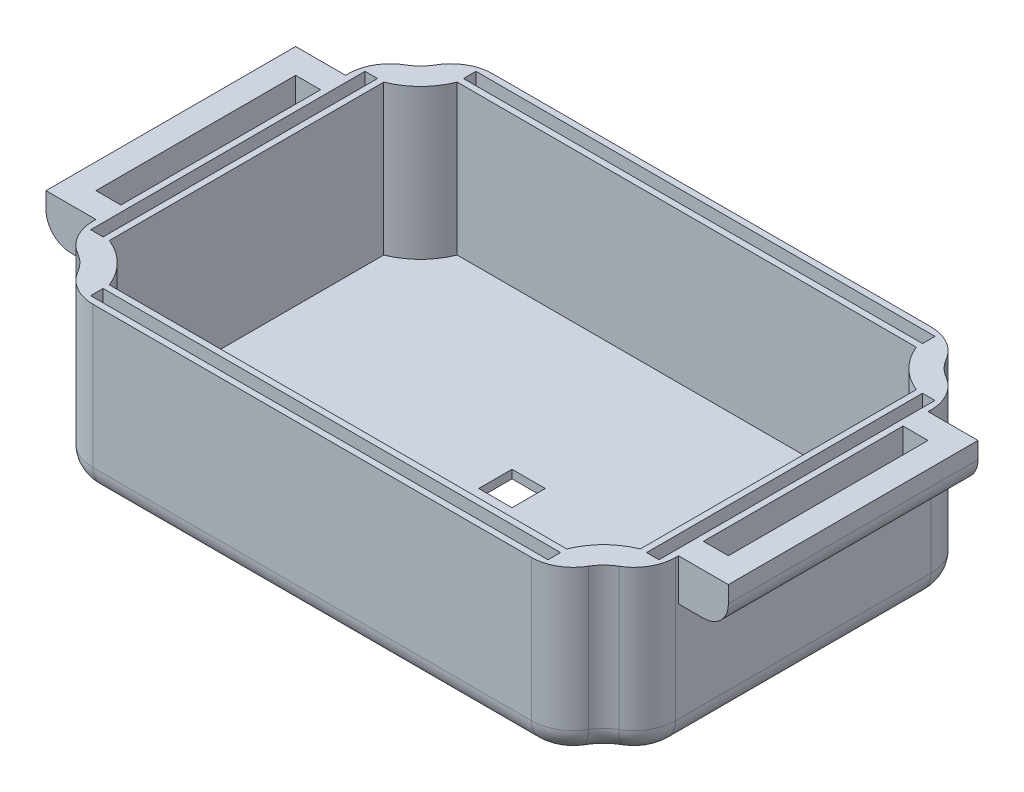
ISO-10303-21;
HEADER;
FILE_DESCRIPTION(('STEP AP214'),'2;1');
FILE_NAME('part.step','',(''),(''),'','','');
FILE_SCHEMA(('AUTOMOTIVE_DESIGN { 1 0 10303 214 1 1 1 1 }'));
ENDSEC;
DATA;
#1=APPLICATION_CONTEXT('core data for automotive mechanical design processes');
#2=APPLICATION_PROTOCOL_DEFINITION('international standard','automotive_design',2000,#1);
#3=PRODUCT_CONTEXT('',#1,'mechanical');
#4=PRODUCT('Part','Part','',(#3));
#5=PRODUCT_RELATED_PRODUCT_CATEGORY('part','',(#4));
#6=PRODUCT_DEFINITION_FORMATION('','',#4);
#7=PRODUCT_DEFINITION_CONTEXT('part definition',#1,'design');
#8=PRODUCT_DEFINITION('design','',#6,#7);
#9=PRODUCT_DEFINITION_SHAPE('','',#8);
#10=(LENGTH_UNIT() NAMED_UNIT(*) SI_UNIT(.MILLI.,.METRE.));
#11=(NAMED_UNIT(*) PLANE_ANGLE_UNIT() SI_UNIT($,.RADIAN.));
#12=(NAMED_UNIT(*) SI_UNIT($,.STERADIAN.) SOLID_ANGLE_UNIT());
#13=UNCERTAINTY_MEASURE_WITH_UNIT(LENGTH_MEASURE(1.E-05),#10,'distance_accuracy_value','');
#14=(GEOMETRIC_REPRESENTATION_CONTEXT(3) GLOBAL_UNCERTAINTY_ASSIGNED_CONTEXT((#13)) GLOBAL_UNIT_ASSIGNED_CONTEXT((#10,
#11,#12)) REPRESENTATION_CONTEXT('',''));
#15=CARTESIAN_POINT('',(0.,0.,0.));
#16=DIRECTION('',(0.,0.,1.));
#17=DIRECTION('',(1.,0.,0.));
#18=AXIS2_PLACEMENT_3D('',#15,#16,#17);
#19=CARTESIAN_POINT('',(0.,15.,0.));
#20=DIRECTION('',(0.,1.,0.));
#21=DIRECTION('',(0.,0.,1.));
#22=AXIS2_PLACEMENT_3D('',#19,#20,#21);
#23=PLANE('',#22);
#24=DIRECTION('',(-1.,0.,0.));
#25=VECTOR('',#24,1.);
#26=CARTESIAN_POINT('',(0.,15.,15.));
#27=LINE('',#26,#25);
#28=CARTESIAN_POINT('',(-35.,15.,15.));
#29=VERTEX_POINT('',#28);
#30=CARTESIAN_POINT('',(-38.,15.,15.));
#31=VERTEX_POINT('',#30);
#32=EDGE_CURVE('E706',#29,#31,#27,.T.);
#33=ORIENTED_EDGE('',*,*,#32,.T.);
#34=DIRECTION('',(0.,0.,1.));
#35=VECTOR('',#34,1.);
#36=CARTESIAN_POINT('',(-38.,15.,-15.));
#37=LINE('',#36,#35);
#38=CARTESIAN_POINT('',(-38.,15.,12.));
#39=VERTEX_POINT('',#38);
#40=EDGE_CURVE('E856',#31,#39,#37,.F.);
#41=ORIENTED_EDGE('',*,*,#40,.T.);
#42=DIRECTION('',(-1.,0.,0.));
#43=VECTOR('',#42,1.);
#44=CARTESIAN_POINT('',(0.,15.,12.));
#45=LINE('',#44,#43);
#46=CARTESIAN_POINT('',(-35.,15.,12.));
#47=VERTEX_POINT('',#46);
#48=EDGE_CURVE('E709',#47,#39,#45,.T.);
#49=ORIENTED_EDGE('',*,*,#48,.F.);
#50=DIRECTION('',(0.,0.,1.));
#51=VECTOR('',#50,1.);
#52=CARTESIAN_POINT('',(-35.,15.,0.));
#53=LINE('',#52,#51);
#54=EDGE_CURVE('E703',#47,#29,#53,.T.);
#55=ORIENTED_EDGE('',*,*,#54,.T.);
#56=EDGE_LOOP('',(#33,#41,#49,#55));
#57=FACE_BOUND('',#56,.T.);
#58=ADVANCED_FACE('F36',(#57),#23,.F.);
#59=CARTESIAN_POINT('',(0.,15.,0.));
#60=DIRECTION('',(0.,1.,0.));
#61=DIRECTION('',(0.,0.,1.));
#62=AXIS2_PLACEMENT_3D('',#59,#60,#61);
#63=PLANE('',#62);
#64=DIRECTION('',(-1.,0.,0.));
#65=VECTOR('',#64,1.);
#66=CARTESIAN_POINT('',(0.,15.,-15.));
#67=LINE('',#66,#65);
#68=CARTESIAN_POINT('',(38.,15.,-15.));
#69=VERTEX_POINT('',#68);
#70=CARTESIAN_POINT('',(35.,15.,-15.));
#71=VERTEX_POINT('',#70);
#72=EDGE_CURVE('E656',#69,#71,#67,.T.);
#73=ORIENTED_EDGE('',*,*,#72,.F.);
#74=DIRECTION('',(0.,0.,1.));
#75=VECTOR('',#74,1.);
#76=CARTESIAN_POINT('',(38.,15.,0.));
#77=LINE('',#76,#75);
#78=CARTESIAN_POINT('',(38.,15.,-12.));
#79=VERTEX_POINT('',#78);
#80=EDGE_CURVE('E840',#69,#79,#77,.T.);
#81=ORIENTED_EDGE('',*,*,#80,.T.);
#82=DIRECTION('',(1.,0.,0.));
#83=VECTOR('',#82,1.);
#84=CARTESIAN_POINT('',(0.,15.,-12.));
#85=LINE('',#84,#83);
#86=CARTESIAN_POINT('',(35.,15.,-12.));
#87=VERTEX_POINT('',#86);
#88=EDGE_CURVE('E642',#87,#79,#85,.T.);
#89=ORIENTED_EDGE('',*,*,#88,.F.);
#90=DIRECTION('',(0.,0.,-1.));
#91=VECTOR('',#90,1.);
#92=CARTESIAN_POINT('',(35.,15.,0.));
#93=LINE('',#92,#91);
#94=EDGE_CURVE('E654',#87,#71,#93,.T.);
#95=ORIENTED_EDGE('',*,*,#94,.T.);
#96=EDGE_LOOP('',(#73,#81,#89,#95));
#97=FACE_BOUND('',#96,.T.);
#98=ADVANCED_FACE('F1146',(#97),#63,.F.);
#99=CARTESIAN_POINT('',(35.,20.,-19.));
#100=DIRECTION('',(-1.,0.,0.));
#101=DIRECTION('',(0.,0.,1.));
#102=AXIS2_PLACEMENT_3D('',#99,#100,#101);
#103=PLANE('',#102);
#104=DIRECTION('',(0.,-1.,0.));
#105=VECTOR('',#104,1.);
#106=CARTESIAN_POINT('',(35.,20.,15.3397459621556));
#107=LINE('',#106,#105);
#108=CARTESIAN_POINT('',(35.,20.,15.3397459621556));
#109=VERTEX_POINT('',#108);
#110=CARTESIAN_POINT('',(35.,3.,15.3397459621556));
#111=VERTEX_POINT('',#110);
#112=EDGE_CURVE('E896',#109,#111,#107,.T.);
#113=ORIENTED_EDGE('',*,*,#112,.T.);
#114=DIRECTION('',(0.,0.,-1.));
#115=VECTOR('',#114,1.);
#116=CARTESIAN_POINT('',(35.,3.,-19.));
#117=LINE('',#116,#115);
#118=CARTESIAN_POINT('',(35.,3.,-15.3397459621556));
#119=VERTEX_POINT('',#118);
#120=EDGE_CURVE('E985',#111,#119,#117,.T.);
#121=ORIENTED_EDGE('',*,*,#120,.T.);
#122=DIRECTION('',(0.,-1.,0.));
#123=VECTOR('',#122,1.);
#124=CARTESIAN_POINT('',(35.,20.,-15.3397459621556));
#125=LINE('',#124,#123);
#126=CARTESIAN_POINT('',(35.,20.,-15.3397459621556));
#127=VERTEX_POINT('',#126);
#128=EDGE_CURVE('E899',#119,#127,#125,.F.);
#129=ORIENTED_EDGE('',*,*,#128,.T.);
#130=DIRECTION('',(0.,0.,-1.));
#131=VECTOR('',#130,1.);
#132=CARTESIAN_POINT('',(35.,20.,-19.));
#133=LINE('',#132,#131);
#134=CARTESIAN_POINT('',(35.,20.,-15.));
#135=VERTEX_POINT('',#134);
#136=EDGE_CURVE('E834',#135,#127,#133,.T.);
#137=ORIENTED_EDGE('',*,*,#136,.F.);
#138=DIRECTION('',(0.,1.,0.));
#139=VECTOR('',#138,1.);
#140=CARTESIAN_POINT('',(35.,15.,-15.));
#141=LINE('',#140,#139);
#142=EDGE_CURVE('E677',#71,#135,#141,.T.);
#143=ORIENTED_EDGE('',*,*,#142,.F.);
#144=ORIENTED_EDGE('',*,*,#94,.F.);
#145=DIRECTION('',(0.,1.,0.));
#146=VECTOR('',#145,1.);
#147=CARTESIAN_POINT('',(35.,15.,-12.));
#148=LINE('',#147,#146);
#149=CARTESIAN_POINT('',(35.,20.,-12.));
#150=VERTEX_POINT('',#149);
#151=EDGE_CURVE('E673',#87,#150,#148,.T.);
#152=ORIENTED_EDGE('',*,*,#151,.T.);
#153=CARTESIAN_POINT('',(35.,20.,12.));
#154=VERTEX_POINT('',#153);
#155=EDGE_CURVE('E838',#154,#150,#133,.T.);
#156=ORIENTED_EDGE('',*,*,#155,.F.);
#157=DIRECTION('',(0.,1.,0.));
#158=VECTOR('',#157,1.);
#159=CARTESIAN_POINT('',(35.,15.,12.));
#160=LINE('',#159,#158);
#161=CARTESIAN_POINT('',(35.,15.,12.));
#162=VERTEX_POINT('',#161);
#163=EDGE_CURVE('E687',#162,#154,#160,.T.);
#164=ORIENTED_EDGE('',*,*,#163,.F.);
#165=CARTESIAN_POINT('',(35.,15.,15.));
#166=VERTEX_POINT('',#165);
#167=EDGE_CURVE('E651',#166,#162,#93,.T.);
#168=ORIENTED_EDGE('',*,*,#167,.F.);
#169=DIRECTION('',(0.,1.,0.));
#170=VECTOR('',#169,1.);
#171=CARTESIAN_POINT('',(35.,15.,15.));
#172=LINE('',#171,#170);
#173=CARTESIAN_POINT('',(35.,20.,15.));
#174=VERTEX_POINT('',#173);
#175=EDGE_CURVE('E684',#166,#174,#172,.T.);
#176=ORIENTED_EDGE('',*,*,#175,.T.);
#177=EDGE_CURVE('E835',#109,#174,#133,.T.);
#178=ORIENTED_EDGE('',*,*,#177,.F.);
#179=EDGE_LOOP('',(#113,#121,#129,#137,#143,#144,#152,#156,#164,#168,#176,#178));
#180=FACE_BOUND('',#179,.T.);
#181=ADVANCED_FACE('F1151',(#180),#103,.F.);
#182=CARTESIAN_POINT('',(35.,20.,-24.));
#183=DIRECTION('',(0.,-1.,0.));
#184=DIRECTION('',(0.,0.,-1.));
#185=AXIS2_PLACEMENT_3D('',#182,#183,#184);
#186=CYLINDRICAL_SURFACE('',#185,5.);
#187=DIRECTION('',(0.,-1.,0.));
#188=VECTOR('',#187,1.);
#189=CARTESIAN_POINT('',(32.5,20.,-19.6698729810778));
#190=LINE('',#189,#188);
#191=CARTESIAN_POINT('',(32.5,20.,-19.6698729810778));
#192=VERTEX_POINT('',#191);
#193=CARTESIAN_POINT('',(32.5,3.,-19.6698729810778));
#194=VERTEX_POINT('',#193);
#195=EDGE_CURVE('E891',#192,#194,#190,.T.);
#196=ORIENTED_EDGE('',*,*,#195,.T.);
#197=CARTESIAN_POINT('',(35.,3.,-24.));
#198=DIRECTION('',(0.,1.,0.));
#199=DIRECTION('',(0.,0.,1.));
#200=AXIS2_PLACEMENT_3D('',#197,#198,#199);
#201=CIRCLE('',#200,5.);
#202=CARTESIAN_POINT('',(30.6698729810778,3.,-21.5));
#203=VERTEX_POINT('',#202);
#204=EDGE_CURVE('E981',#194,#203,#201,.F.);
#205=ORIENTED_EDGE('',*,*,#204,.T.);
#206=DIRECTION('',(0.,-1.,0.));
#207=VECTOR('',#206,1.);
#208=CARTESIAN_POINT('',(30.6698729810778,20.,-21.5));
#209=LINE('',#208,#207);
#210=CARTESIAN_POINT('',(30.6698729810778,20.,-21.5));
#211=VERTEX_POINT('',#210);
#212=EDGE_CURVE('E894',#203,#211,#209,.F.);
#213=ORIENTED_EDGE('',*,*,#212,.T.);
#214=CARTESIAN_POINT('',(35.,20.,-24.));
#215=DIRECTION('',(0.,-1.,0.));
#216=DIRECTION('',(0.,0.,1.));
#217=AXIS2_PLACEMENT_3D('',#214,#215,#216);
#218=CIRCLE('',#217,5.);
#219=EDGE_CURVE('E798',#192,#211,#218,.T.);
#220=ORIENTED_EDGE('',*,*,#219,.F.);
#221=EDGE_LOOP('',(#196,#205,#213,#220));
#222=FACE_BOUND('',#221,.T.);
#223=ADVANCED_FACE('F1219',(#222),#186,.F.);
#224=CARTESIAN_POINT('',(30.,20.,-24.));
#225=DIRECTION('',(0.,0.,1.));
#226=DIRECTION('',(1.,0.,0.));
#227=AXIS2_PLACEMENT_3D('',#224,#225,#226);
#228=PLANE('',#227);
#229=DIRECTION('',(0.,-1.,0.));
#230=VECTOR('',#229,1.);
#231=CARTESIAN_POINT('',(26.3397459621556,20.,-24.));
#232=LINE('',#231,#230);
#233=CARTESIAN_POINT('',(26.3397459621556,20.,-24.));
#234=VERTEX_POINT('',#233);
#235=CARTESIAN_POINT('',(26.3397459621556,3.,-24.));
#236=VERTEX_POINT('',#235);
#237=EDGE_CURVE('E865',#234,#236,#232,.T.);
#238=ORIENTED_EDGE('',*,*,#237,.T.);
#239=DIRECTION('',(-1.,0.,0.));
#240=VECTOR('',#239,1.);
#241=CARTESIAN_POINT('',(30.,3.,-24.));
#242=LINE('',#241,#240);
#243=CARTESIAN_POINT('',(-26.3397459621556,3.,-24.));
#244=VERTEX_POINT('',#243);
#245=EDGE_CURVE('E977',#236,#244,#242,.T.);
#246=ORIENTED_EDGE('',*,*,#245,.T.);
#247=DIRECTION('',(0.,-1.,0.));
#248=VECTOR('',#247,1.);
#249=CARTESIAN_POINT('',(-26.3397459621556,20.,-24.));
#250=LINE('',#249,#248);
#251=CARTESIAN_POINT('',(-26.3397459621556,20.,-24.));
#252=VERTEX_POINT('',#251);
#253=EDGE_CURVE('E868',#244,#252,#250,.F.);
#254=ORIENTED_EDGE('',*,*,#253,.T.);
#255=DIRECTION('',(-1.,0.,0.));
#256=VECTOR('',#255,1.);
#257=CARTESIAN_POINT('',(30.,20.,-24.));
#258=LINE('',#257,#256);
#259=EDGE_CURVE('E815',#234,#252,#258,.T.);
#260=ORIENTED_EDGE('',*,*,#259,.F.);
#261=EDGE_LOOP('',(#238,#246,#254,#260));
#262=FACE_BOUND('',#261,.T.);
#263=ADVANCED_FACE('F1053',(#262),#228,.F.);
#264=CARTESIAN_POINT('',(-35.,20.,-24.));
#265=DIRECTION('',(0.,-1.,0.));
#266=DIRECTION('',(0.,0.,-1.));
#267=AXIS2_PLACEMENT_3D('',#264,#265,#266);
#268=CYLINDRICAL_SURFACE('',#267,5.);
#269=DIRECTION('',(0.,-1.,0.));
#270=VECTOR('',#269,1.);
#271=CARTESIAN_POINT('',(-30.6698729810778,20.,-21.5));
#272=LINE('',#271,#270);
#273=CARTESIAN_POINT('',(-30.6698729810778,20.,-21.5));
#274=VERTEX_POINT('',#273);
#275=CARTESIAN_POINT('',(-30.6698729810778,3.,-21.5));
#276=VERTEX_POINT('',#275);
#277=EDGE_CURVE('E862',#274,#276,#272,.T.);
#278=ORIENTED_EDGE('',*,*,#277,.T.);
#279=CARTESIAN_POINT('',(-35.,3.,-24.));
#280=DIRECTION('',(0.,1.,0.));
#281=DIRECTION('',(0.,0.,1.));
#282=AXIS2_PLACEMENT_3D('',#279,#280,#281);
#283=CIRCLE('',#282,5.);
#284=CARTESIAN_POINT('',(-32.5,3.,-19.6698729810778));
#285=VERTEX_POINT('',#284);
#286=EDGE_CURVE('E973',#276,#285,#283,.F.);
#287=ORIENTED_EDGE('',*,*,#286,.T.);
#288=DIRECTION('',(0.,-1.,0.));
#289=VECTOR('',#288,1.);
#290=CARTESIAN_POINT('',(-32.5,20.,-19.6698729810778));
#291=LINE('',#290,#289);
#292=CARTESIAN_POINT('',(-32.5,20.,-19.6698729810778));
#293=VERTEX_POINT('',#292);
#294=EDGE_CURVE('E860',#285,#293,#291,.F.);
#295=ORIENTED_EDGE('',*,*,#294,.T.);
#296=CARTESIAN_POINT('',(-35.,20.,-24.));
#297=DIRECTION('',(0.,-1.,0.));
#298=DIRECTION('',(0.,0.,1.));
#299=AXIS2_PLACEMENT_3D('',#296,#297,#298);
#300=CIRCLE('',#299,5.);
#301=EDGE_CURVE('E818',#274,#293,#300,.T.);
#302=ORIENTED_EDGE('',*,*,#301,.F.);
#303=EDGE_LOOP('',(#278,#287,#295,#302));
#304=FACE_BOUND('',#303,.T.);
#305=ADVANCED_FACE('F1067',(#304),#268,.F.);
#306=CARTESIAN_POINT('',(-35.,20.,-19.));
#307=DIRECTION('',(1.,0.,0.));
#308=DIRECTION('',(0.,0.,-1.));
#309=AXIS2_PLACEMENT_3D('',#306,#307,#308);
#310=PLANE('',#309);
#311=DIRECTION('',(0.,-1.,0.));
#312=VECTOR('',#311,1.);
#313=CARTESIAN_POINT('',(-35.,20.,-15.3397459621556));
#314=LINE('',#313,#312);
#315=CARTESIAN_POINT('',(-35.,20.,-15.3397459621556));
#316=VERTEX_POINT('',#315);
#317=CARTESIAN_POINT('',(-35.,3.,-15.3397459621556));
#318=VERTEX_POINT('',#317);
#319=EDGE_CURVE('E888',#316,#318,#314,.T.);
#320=ORIENTED_EDGE('',*,*,#319,.T.);
#321=DIRECTION('',(0.,0.,1.));
#322=VECTOR('',#321,1.);
#323=CARTESIAN_POINT('',(-35.,3.,-19.));
#324=LINE('',#323,#322);
#325=CARTESIAN_POINT('',(-35.,3.,15.3397459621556));
#326=VERTEX_POINT('',#325);
#327=EDGE_CURVE('E969',#318,#326,#324,.T.);
#328=ORIENTED_EDGE('',*,*,#327,.T.);
#329=DIRECTION('',(0.,-1.,0.));
#330=VECTOR('',#329,1.);
#331=CARTESIAN_POINT('',(-35.,20.,15.3397459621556));
#332=LINE('',#331,#330);
#333=CARTESIAN_POINT('',(-35.,20.,15.3397459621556));
#334=VERTEX_POINT('',#333);
#335=EDGE_CURVE('E886',#326,#334,#332,.F.);
#336=ORIENTED_EDGE('',*,*,#335,.T.);
#337=DIRECTION('',(0.,0.,1.));
#338=VECTOR('',#337,1.);
#339=CARTESIAN_POINT('',(-35.,20.,-19.));
#340=LINE('',#339,#338);
#341=CARTESIAN_POINT('',(-35.,20.,15.));
#342=VERTEX_POINT('',#341);
#343=EDGE_CURVE('E821',#342,#334,#340,.T.);
#344=ORIENTED_EDGE('',*,*,#343,.F.);
#345=DIRECTION('',(0.,1.,0.));
#346=VECTOR('',#345,1.);
#347=CARTESIAN_POINT('',(-35.,15.,15.));
#348=LINE('',#347,#346);
#349=EDGE_CURVE('E734',#29,#342,#348,.T.);
#350=ORIENTED_EDGE('',*,*,#349,.F.);
#351=ORIENTED_EDGE('',*,*,#54,.F.);
#352=DIRECTION('',(0.,1.,0.));
#353=VECTOR('',#352,1.);
#354=CARTESIAN_POINT('',(-35.,15.,12.));
#355=LINE('',#354,#353);
#356=CARTESIAN_POINT('',(-35.,20.,12.));
#357=VERTEX_POINT('',#356);
#358=EDGE_CURVE('E731',#47,#357,#355,.T.);
#359=ORIENTED_EDGE('',*,*,#358,.T.);
#360=CARTESIAN_POINT('',(-35.,20.,-12.));
#361=VERTEX_POINT('',#360);
#362=EDGE_CURVE('E825',#361,#357,#340,.T.);
#363=ORIENTED_EDGE('',*,*,#362,.F.);
#364=DIRECTION('',(0.,1.,0.));
#365=VECTOR('',#364,1.);
#366=CARTESIAN_POINT('',(-35.,15.,-12.));
#367=LINE('',#366,#365);
#368=CARTESIAN_POINT('',(-35.,15.,-12.));
#369=VERTEX_POINT('',#368);
#370=EDGE_CURVE('E744',#369,#361,#367,.T.);
#371=ORIENTED_EDGE('',*,*,#370,.F.);
#372=CARTESIAN_POINT('',(-35.,15.,-15.));
#373=VERTEX_POINT('',#372);
#374=EDGE_CURVE('E700',#373,#369,#53,.T.);
#375=ORIENTED_EDGE('',*,*,#374,.F.);
#376=DIRECTION('',(0.,1.,0.));
#377=VECTOR('',#376,1.);
#378=CARTESIAN_POINT('',(-35.,15.,-15.));
#379=LINE('',#378,#377);
#380=CARTESIAN_POINT('',(-35.,20.,-15.));
#381=VERTEX_POINT('',#380);
#382=EDGE_CURVE('E741',#373,#381,#379,.T.);
#383=ORIENTED_EDGE('',*,*,#382,.T.);
#384=EDGE_CURVE('E822',#316,#381,#340,.T.);
#385=ORIENTED_EDGE('',*,*,#384,.F.);
#386=EDGE_LOOP('',(#320,#328,#336,#344,#350,#351,#359,#363,#371,#375,#383,#385));
#387=FACE_BOUND('',#386,.T.);
#388=ADVANCED_FACE('F1089',(#387),#310,.F.);
#389=CARTESIAN_POINT('',(-35.,20.,24.));
#390=DIRECTION('',(0.,-1.,0.));
#391=DIRECTION('',(0.,0.,-1.));
#392=AXIS2_PLACEMENT_3D('',#389,#390,#391);
#393=CYLINDRICAL_SURFACE('',#392,5.);
#394=DIRECTION('',(0.,-1.,0.));
#395=VECTOR('',#394,1.);
#396=CARTESIAN_POINT('',(-32.5,20.,19.6698729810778));
#397=LINE('',#396,#395);
#398=CARTESIAN_POINT('',(-32.5,20.,19.6698729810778));
#399=VERTEX_POINT('',#398);
#400=CARTESIAN_POINT('',(-32.5,3.,19.6698729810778));
#401=VERTEX_POINT('',#400);
#402=EDGE_CURVE('E913',#399,#401,#397,.T.);
#403=ORIENTED_EDGE('',*,*,#402,.T.);
#404=CARTESIAN_POINT('',(-35.,3.,24.));
#405=DIRECTION('',(0.,1.,0.));
#406=DIRECTION('',(0.,0.,1.));
#407=AXIS2_PLACEMENT_3D('',#404,#405,#406);
#408=CIRCLE('',#407,5.);
#409=CARTESIAN_POINT('',(-30.6698729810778,3.,21.5));
#410=VERTEX_POINT('',#409);
#411=EDGE_CURVE('E965',#401,#410,#408,.F.);
#412=ORIENTED_EDGE('',*,*,#411,.T.);
#413=DIRECTION('',(0.,-1.,0.));
#414=VECTOR('',#413,1.);
#415=CARTESIAN_POINT('',(-30.6698729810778,20.,21.5));
#416=LINE('',#415,#414);
#417=CARTESIAN_POINT('',(-30.6698729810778,20.,21.5));
#418=VERTEX_POINT('',#417);
#419=EDGE_CURVE('E911',#410,#418,#416,.F.);
#420=ORIENTED_EDGE('',*,*,#419,.T.);
#421=CARTESIAN_POINT('',(-35.,20.,24.));
#422=DIRECTION('',(0.,-1.,0.));
#423=DIRECTION('',(0.,0.,1.));
#424=AXIS2_PLACEMENT_3D('',#421,#422,#423);
#425=CIRCLE('',#424,5.);
#426=EDGE_CURVE('E824',#399,#418,#425,.T.);
#427=ORIENTED_EDGE('',*,*,#426,.F.);
#428=EDGE_LOOP('',(#403,#412,#420,#427));
#429=FACE_BOUND('',#428,.T.);
#430=ADVANCED_FACE('F1227',(#429),#393,.F.);
#431=CARTESIAN_POINT('',(30.,20.,24.));
#432=DIRECTION('',(0.,0.,-1.));
#433=DIRECTION('',(-1.,0.,0.));
#434=AXIS2_PLACEMENT_3D('',#431,#432,#433);
#435=PLANE('',#434);
#436=DIRECTION('',(0.,-1.,0.));
#437=VECTOR('',#436,1.);
#438=CARTESIAN_POINT('',(-26.3397459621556,20.,24.));
#439=LINE('',#438,#437);
#440=CARTESIAN_POINT('',(-26.3397459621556,20.,24.));
#441=VERTEX_POINT('',#440);
#442=CARTESIAN_POINT('',(-26.3397459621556,3.,24.));
#443=VERTEX_POINT('',#442);
#444=EDGE_CURVE('E906',#441,#443,#439,.T.);
#445=ORIENTED_EDGE('',*,*,#444,.T.);
#446=DIRECTION('',(1.,0.,0.));
#447=VECTOR('',#446,1.);
#448=CARTESIAN_POINT('',(30.,3.,24.));
#449=LINE('',#448,#447);
#450=CARTESIAN_POINT('',(26.3397459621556,3.,24.));
#451=VERTEX_POINT('',#450);
#452=EDGE_CURVE('E11',#443,#451,#449,.T.);
#453=ORIENTED_EDGE('',*,*,#452,.T.);
#454=DIRECTION('',(0.,-1.,0.));
#455=VECTOR('',#454,1.);
#456=CARTESIAN_POINT('',(26.3397459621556,20.,24.));
#457=LINE('',#456,#455);
#458=CARTESIAN_POINT('',(26.3397459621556,20.,24.));
#459=VERTEX_POINT('',#458);
#460=EDGE_CURVE('E909',#451,#459,#457,.F.);
#461=ORIENTED_EDGE('',*,*,#460,.T.);
#462=DIRECTION('',(1.,0.,0.));
#463=VECTOR('',#462,1.);
#464=CARTESIAN_POINT('',(30.,20.,24.));
#465=LINE('',#464,#463);
#466=EDGE_CURVE('E828',#441,#459,#465,.T.);
#467=ORIENTED_EDGE('',*,*,#466,.F.);
#468=EDGE_LOOP('',(#445,#453,#461,#467));
#469=FACE_BOUND('',#468,.T.);
#470=ADVANCED_FACE('F1223',(#469),#435,.F.);
#471=CARTESIAN_POINT('',(35.,20.,24.));
#472=DIRECTION('',(0.,-1.,0.));
#473=DIRECTION('',(0.,0.,-1.));
#474=AXIS2_PLACEMENT_3D('',#471,#472,#473);
#475=CYLINDRICAL_SURFACE('',#474,5.);
#476=DIRECTION('',(0.,-1.,0.));
#477=VECTOR('',#476,1.);
#478=CARTESIAN_POINT('',(30.6698729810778,20.,21.5));
#479=LINE('',#478,#477);
#480=CARTESIAN_POINT('',(30.6698729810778,20.,21.5));
#481=VERTEX_POINT('',#480);
#482=CARTESIAN_POINT('',(30.6698729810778,3.,21.5));
#483=VERTEX_POINT('',#482);
#484=EDGE_CURVE('E903',#481,#483,#479,.T.);
#485=ORIENTED_EDGE('',*,*,#484,.T.);
#486=CARTESIAN_POINT('',(35.,3.,24.));
#487=DIRECTION('',(0.,1.,0.));
#488=DIRECTION('',(0.,0.,1.));
#489=AXIS2_PLACEMENT_3D('',#486,#487,#488);
#490=CIRCLE('',#489,5.);
#491=CARTESIAN_POINT('',(32.5,3.,19.6698729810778));
#492=VERTEX_POINT('',#491);
#493=EDGE_CURVE('E989',#483,#492,#490,.F.);
#494=ORIENTED_EDGE('',*,*,#493,.T.);
#495=DIRECTION('',(0.,-1.,0.));
#496=VECTOR('',#495,1.);
#497=CARTESIAN_POINT('',(32.5,20.,19.6698729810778));
#498=LINE('',#497,#496);
#499=CARTESIAN_POINT('',(32.5,20.,19.6698729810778));
#500=VERTEX_POINT('',#499);
#501=EDGE_CURVE('E901',#492,#500,#498,.F.);
#502=ORIENTED_EDGE('',*,*,#501,.T.);
#503=CARTESIAN_POINT('',(35.,20.,24.));
#504=DIRECTION('',(0.,-1.,0.));
#505=DIRECTION('',(0.,0.,1.));
#506=AXIS2_PLACEMENT_3D('',#503,#504,#505);
#507=CIRCLE('',#506,5.);
#508=EDGE_CURVE('E831',#481,#500,#507,.T.);
#509=ORIENTED_EDGE('',*,*,#508,.F.);
#510=EDGE_LOOP('',(#485,#494,#502,#509));
#511=FACE_BOUND('',#510,.T.);
#512=ADVANCED_FACE('F1212',(#511),#475,.F.);
#513=CARTESIAN_POINT('',(35.,20.,-24.));
#514=DIRECTION('',(0.,1.,0.));
#515=DIRECTION('',(0.,0.,1.));
#516=AXIS2_PLACEMENT_3D('',#513,#514,#515);
#517=PLANE('',#516);
#518=DIRECTION('',(0.,0.,-1.));
#519=VECTOR('',#518,1.);
#520=CARTESIAN_POINT('',(-32.75,20.,16.3874291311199));
#521=LINE('',#520,#519);
#522=CARTESIAN_POINT('',(-32.75,20.,16.3874291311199));
#523=VERTEX_POINT('',#522);
#524=CARTESIAN_POINT('',(-32.75,20.,-16.5838015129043));
#525=VERTEX_POINT('',#524);
#526=EDGE_CURVE('E53',#523,#525,#521,.T.);
#527=ORIENTED_EDGE('',*,*,#526,.F.);
#528=DIRECTION('',(1.,0.,0.));
#529=VECTOR('',#528,1.);
#530=CARTESIAN_POINT('',(-32.75,20.,16.3874291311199));
#531=LINE('',#530,#529);
#532=CARTESIAN_POINT('',(-34.25,20.,16.3874291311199));
#533=VERTEX_POINT('',#532);
#534=EDGE_CURVE('E494',#533,#523,#531,.T.);
#535=ORIENTED_EDGE('',*,*,#534,.F.);
#536=DIRECTION('',(0.,0.,1.));
#537=VECTOR('',#536,1.);
#538=CARTESIAN_POINT('',(-34.25,20.,16.3874291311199));
#539=LINE('',#538,#537);
#540=CARTESIAN_POINT('',(-34.25,20.,-16.5838015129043));
#541=VERTEX_POINT('',#540);
#542=EDGE_CURVE('E497',#541,#533,#539,.T.);
#543=ORIENTED_EDGE('',*,*,#542,.F.);
#544=DIRECTION('',(-1.,0.,0.));
#545=VECTOR('',#544,1.);
#546=CARTESIAN_POINT('',(-32.75,20.,-16.5838015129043));
#547=LINE('',#546,#545);
#548=EDGE_CURVE('E503',#525,#541,#547,.T.);
#549=ORIENTED_EDGE('',*,*,#548,.F.);
#550=EDGE_LOOP('',(#527,#535,#543,#549));
#551=FACE_BOUND('',#550,.T.);
#552=DIRECTION('',(0.,0.,1.));
#553=VECTOR('',#552,1.);
#554=CARTESIAN_POINT('',(32.75,20.,16.5838015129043));
#555=LINE('',#554,#553);
#556=CARTESIAN_POINT('',(32.75,20.,-16.5838015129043));
#557=VERTEX_POINT('',#556);
#558=CARTESIAN_POINT('',(32.75,20.,16.5838015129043));
#559=VERTEX_POINT('',#558);
#560=EDGE_CURVE('E61',#557,#559,#555,.T.);
#561=ORIENTED_EDGE('',*,*,#560,.F.);
#562=DIRECTION('',(-1.,0.,0.));
#563=VECTOR('',#562,1.);
#564=CARTESIAN_POINT('',(32.75,20.,-16.5838015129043));
#565=LINE('',#564,#563);
#566=CARTESIAN_POINT('',(34.25,20.,-16.5838015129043));
#567=VERTEX_POINT('',#566);
#568=EDGE_CURVE('E518',#567,#557,#565,.T.);
#569=ORIENTED_EDGE('',*,*,#568,.F.);
#570=DIRECTION('',(0.,0.,-1.));
#571=VECTOR('',#570,1.);
#572=CARTESIAN_POINT('',(34.25,20.,16.5838015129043));
#573=LINE('',#572,#571);
#574=CARTESIAN_POINT('',(34.25,20.,16.5838015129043));
#575=VERTEX_POINT('',#574);
#576=EDGE_CURVE('E533',#575,#567,#573,.T.);
#577=ORIENTED_EDGE('',*,*,#576,.F.);
#578=DIRECTION('',(1.,0.,0.));
#579=VECTOR('',#578,1.);
#580=CARTESIAN_POINT('',(32.75,20.,16.5838015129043));
#581=LINE('',#580,#579);
#582=EDGE_CURVE('E529',#559,#575,#581,.T.);
#583=ORIENTED_EDGE('',*,*,#582,.F.);
#584=EDGE_LOOP('',(#561,#569,#577,#583));
#585=FACE_BOUND('',#584,.T.);
#586=DIRECTION('',(0.,0.,1.));
#587=VECTOR('',#586,1.);
#588=CARTESIAN_POINT('',(-27.3874291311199,20.,21.75));
#589=LINE('',#588,#587);
#590=CARTESIAN_POINT('',(-27.3874291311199,20.,21.75));
#591=VERTEX_POINT('',#590);
#592=CARTESIAN_POINT('',(-27.3874291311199,20.,23.25));
#593=VERTEX_POINT('',#592);
#594=EDGE_CURVE('E558',#591,#593,#589,.T.);
#595=ORIENTED_EDGE('',*,*,#594,.F.);
#596=DIRECTION('',(-1.,0.,0.));
#597=VECTOR('',#596,1.);
#598=CARTESIAN_POINT('',(-27.3874291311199,20.,21.75));
#599=LINE('',#598,#597);
#600=CARTESIAN_POINT('',(27.5838015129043,20.,21.75));
#601=VERTEX_POINT('',#600);
#602=EDGE_CURVE('E548',#601,#591,#599,.T.);
#603=ORIENTED_EDGE('',*,*,#602,.F.);
#604=DIRECTION('',(0.,0.,-1.));
#605=VECTOR('',#604,1.);
#606=CARTESIAN_POINT('',(27.5838015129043,20.,21.75));
#607=LINE('',#606,#605);
#608=CARTESIAN_POINT('',(27.5838015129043,20.,23.25));
#609=VERTEX_POINT('',#608);
#610=EDGE_CURVE('E564',#609,#601,#607,.T.);
#611=ORIENTED_EDGE('',*,*,#610,.F.);
#612=DIRECTION('',(1.,0.,0.));
#613=VECTOR('',#612,1.);
#614=CARTESIAN_POINT('',(-27.3874291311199,20.,23.25));
#615=LINE('',#614,#613);
#616=EDGE_CURVE('E560',#593,#609,#615,.T.);
#617=ORIENTED_EDGE('',*,*,#616,.F.);
#618=EDGE_LOOP('',(#595,#603,#611,#617));
#619=FACE_BOUND('',#618,.T.);
#620=DIRECTION('',(0.,0.,1.));
#621=VECTOR('',#620,1.);
#622=CARTESIAN_POINT('',(-27.5838015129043,20.,-21.75));
#623=LINE('',#622,#621);
#624=CARTESIAN_POINT('',(-27.5838015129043,20.,-23.25));
#625=VERTEX_POINT('',#624);
#626=CARTESIAN_POINT('',(-27.5838015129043,20.,-21.75));
#627=VERTEX_POINT('',#626);
#628=EDGE_CURVE('E590',#625,#627,#623,.T.);
#629=ORIENTED_EDGE('',*,*,#628,.F.);
#630=DIRECTION('',(-1.,0.,0.));
#631=VECTOR('',#630,1.);
#632=CARTESIAN_POINT('',(-27.5838015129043,20.,-23.25));
#633=LINE('',#632,#631);
#634=CARTESIAN_POINT('',(27.5838015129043,20.,-23.25));
#635=VERTEX_POINT('',#634);
#636=EDGE_CURVE('E580',#635,#625,#633,.T.);
#637=ORIENTED_EDGE('',*,*,#636,.F.);
#638=DIRECTION('',(0.,0.,-1.));
#639=VECTOR('',#638,1.);
#640=CARTESIAN_POINT('',(27.5838015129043,20.,-21.75));
#641=LINE('',#640,#639);
#642=CARTESIAN_POINT('',(27.5838015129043,20.,-21.75));
#643=VERTEX_POINT('',#642);
#644=EDGE_CURVE('E595',#643,#635,#641,.T.);
#645=ORIENTED_EDGE('',*,*,#644,.F.);
#646=DIRECTION('',(1.,0.,0.));
#647=VECTOR('',#646,1.);
#648=CARTESIAN_POINT('',(-27.5838015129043,20.,-21.75));
#649=LINE('',#648,#647);
#650=EDGE_CURVE('E592',#627,#643,#649,.T.);
#651=ORIENTED_EDGE('',*,*,#650,.F.);
#652=EDGE_LOOP('',(#629,#637,#645,#651));
#653=FACE_BOUND('',#652,.T.);
#654=ORIENTED_EDGE('',*,*,#259,.T.);
#655=CARTESIAN_POINT('',(-26.3397459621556,20.,-19.));
#656=DIRECTION('',(0.,1.,0.));
#657=DIRECTION('',(0.,0.,1.));
#658=AXIS2_PLACEMENT_3D('',#655,#656,#657);
#659=CIRCLE('',#658,5.);
#660=EDGE_CURVE('E884',#252,#274,#659,.T.);
#661=ORIENTED_EDGE('',*,*,#660,.T.);
#662=ORIENTED_EDGE('',*,*,#301,.T.);
#663=CARTESIAN_POINT('',(-30.,20.,-15.3397459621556));
#664=DIRECTION('',(0.,1.,0.));
#665=DIRECTION('',(0.,0.,1.));
#666=AXIS2_PLACEMENT_3D('',#663,#664,#665);
#667=CIRCLE('',#666,5.);
#668=EDGE_CURVE('E882',#293,#316,#667,.T.);
#669=ORIENTED_EDGE('',*,*,#668,.T.);
#670=ORIENTED_EDGE('',*,*,#384,.T.);
#671=DIRECTION('',(-1.,0.,0.));
#672=VECTOR('',#671,1.);
#673=CARTESIAN_POINT('',(0.,20.,-15.));
#674=LINE('',#673,#672);
#675=CARTESIAN_POINT('',(-41.,20.,-15.));
#676=VERTEX_POINT('',#675);
#677=EDGE_CURVE('E717',#381,#676,#674,.T.);
#678=ORIENTED_EDGE('',*,*,#677,.T.);
#679=DIRECTION('',(0.,0.,1.));
#680=VECTOR('',#679,1.);
#681=CARTESIAN_POINT('',(-41.,20.,0.));
#682=LINE('',#681,#680);
#683=CARTESIAN_POINT('',(-41.,20.,15.));
#684=VERTEX_POINT('',#683);
#685=EDGE_CURVE('E720',#676,#684,#682,.T.);
#686=ORIENTED_EDGE('',*,*,#685,.T.);
#687=DIRECTION('',(-1.,0.,0.));
#688=VECTOR('',#687,1.);
#689=CARTESIAN_POINT('',(0.,20.,15.));
#690=LINE('',#689,#688);
#691=EDGE_CURVE('E723',#342,#684,#690,.T.);
#692=ORIENTED_EDGE('',*,*,#691,.F.);
#693=ORIENTED_EDGE('',*,*,#343,.T.);
#694=CARTESIAN_POINT('',(-30.,20.,15.3397459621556));
#695=DIRECTION('',(0.,1.,0.));
#696=DIRECTION('',(0.,0.,1.));
#697=AXIS2_PLACEMENT_3D('',#694,#695,#696);
#698=CIRCLE('',#697,5.);
#699=EDGE_CURVE('E872',#334,#399,#698,.T.);
#700=ORIENTED_EDGE('',*,*,#699,.T.);
#701=ORIENTED_EDGE('',*,*,#426,.T.);
#702=CARTESIAN_POINT('',(-26.3397459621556,20.,19.));
#703=DIRECTION('',(0.,1.,0.));
#704=DIRECTION('',(0.,0.,1.));
#705=AXIS2_PLACEMENT_3D('',#702,#703,#704);
#706=CIRCLE('',#705,5.);
#707=EDGE_CURVE('E870',#418,#441,#706,.T.);
#708=ORIENTED_EDGE('',*,*,#707,.T.);
#709=ORIENTED_EDGE('',*,*,#466,.T.);
#710=CARTESIAN_POINT('',(26.3397459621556,20.,19.));
#711=DIRECTION('',(0.,1.,0.));
#712=DIRECTION('',(0.,0.,1.));
#713=AXIS2_PLACEMENT_3D('',#710,#711,#712);
#714=CIRCLE('',#713,5.);
#715=EDGE_CURVE('E876',#459,#481,#714,.T.);
#716=ORIENTED_EDGE('',*,*,#715,.T.);
#717=ORIENTED_EDGE('',*,*,#508,.T.);
#718=CARTESIAN_POINT('',(30.,20.,15.3397459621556));
#719=DIRECTION('',(0.,1.,0.));
#720=DIRECTION('',(0.,0.,1.));
#721=AXIS2_PLACEMENT_3D('',#718,#719,#720);
#722=CIRCLE('',#721,5.);
#723=EDGE_CURVE('E874',#500,#109,#722,.T.);
#724=ORIENTED_EDGE('',*,*,#723,.T.);
#725=ORIENTED_EDGE('',*,*,#177,.T.);
#726=DIRECTION('',(-1.,0.,0.));
#727=VECTOR('',#726,1.);
#728=CARTESIAN_POINT('',(0.,20.,15.));
#729=LINE('',#728,#727);
#730=CARTESIAN_POINT('',(41.,20.,15.));
#731=VERTEX_POINT('',#730);
#732=EDGE_CURVE('E666',#731,#174,#729,.T.);
#733=ORIENTED_EDGE('',*,*,#732,.F.);
#734=DIRECTION('',(0.,0.,1.));
#735=VECTOR('',#734,1.);
#736=CARTESIAN_POINT('',(41.,20.,0.));
#737=LINE('',#736,#735);
#738=CARTESIAN_POINT('',(41.,20.,-15.));
#739=VERTEX_POINT('',#738);
#740=EDGE_CURVE('E669',#739,#731,#737,.T.);
#741=ORIENTED_EDGE('',*,*,#740,.F.);
#742=DIRECTION('',(-1.,0.,0.));
#743=VECTOR('',#742,1.);
#744=CARTESIAN_POINT('',(0.,20.,-15.));
#745=LINE('',#744,#743);
#746=EDGE_CURVE('E646',#739,#135,#745,.T.);
#747=ORIENTED_EDGE('',*,*,#746,.T.);
#748=ORIENTED_EDGE('',*,*,#136,.T.);
#749=CARTESIAN_POINT('',(30.,20.,-15.3397459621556));
#750=DIRECTION('',(0.,1.,0.));
#751=DIRECTION('',(0.,0.,1.));
#752=AXIS2_PLACEMENT_3D('',#749,#750,#751);
#753=CIRCLE('',#752,5.);
#754=EDGE_CURVE('E878',#127,#192,#753,.T.);
#755=ORIENTED_EDGE('',*,*,#754,.T.);
#756=ORIENTED_EDGE('',*,*,#219,.T.);
#757=CARTESIAN_POINT('',(26.3397459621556,20.,-19.));
#758=DIRECTION('',(0.,1.,0.));
#759=DIRECTION('',(0.,0.,1.));
#760=AXIS2_PLACEMENT_3D('',#757,#758,#759);
#761=CIRCLE('',#760,5.);
#762=EDGE_CURVE('E880',#211,#234,#761,.T.);
#763=ORIENTED_EDGE('',*,*,#762,.T.);
#764=EDGE_LOOP('',(#654,#661,#662,#669,#670,#678,#686,#692,#693,#700,#701,#708,#709,#716,#717,
#724,#725,#733,#741,#747,#748,#755,#756,#763));
#765=FACE_BOUND('',#764,.T.);
#766=ORIENTED_EDGE('',*,*,#155,.T.);
#767=DIRECTION('',(1.,0.,0.));
#768=VECTOR('',#767,1.);
#769=CARTESIAN_POINT('',(0.,20.,-12.));
#770=LINE('',#769,#768);
#771=CARTESIAN_POINT('',(38.,20.,-12.));
#772=VERTEX_POINT('',#771);
#773=EDGE_CURVE('E639',#150,#772,#770,.T.);
#774=ORIENTED_EDGE('',*,*,#773,.T.);
#775=DIRECTION('',(0.,0.,1.));
#776=VECTOR('',#775,1.);
#777=CARTESIAN_POINT('',(38.,20.,0.));
#778=LINE('',#777,#776);
#779=CARTESIAN_POINT('',(38.,20.,12.));
#780=VERTEX_POINT('',#779);
#781=EDGE_CURVE('E660',#772,#780,#778,.T.);
#782=ORIENTED_EDGE('',*,*,#781,.T.);
#783=DIRECTION('',(1.,0.,0.));
#784=VECTOR('',#783,1.);
#785=CARTESIAN_POINT('',(0.,20.,12.));
#786=LINE('',#785,#784);
#787=EDGE_CURVE('E663',#154,#780,#786,.T.);
#788=ORIENTED_EDGE('',*,*,#787,.F.);
#789=EDGE_LOOP('',(#766,#774,#782,#788));
#790=FACE_BOUND('',#789,.T.);
#791=CARTESIAN_POINT('',(35.,20.,-24.));
#792=DIRECTION('',(0.,-1.,0.));
#793=DIRECTION('',(0.,0.,1.));
#794=AXIS2_PLACEMENT_3D('',#791,#792,#793);
#795=CIRCLE('',#794,8.);
#796=CARTESIAN_POINT('',(32.,20.,-16.5838015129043));
#797=VERTEX_POINT('',#796);
#798=CARTESIAN_POINT('',(27.5838015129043,20.,-21.));
#799=VERTEX_POINT('',#798);
#800=EDGE_CURVE('E730',#797,#799,#795,.T.);
#801=ORIENTED_EDGE('',*,*,#800,.F.);
#802=DIRECTION('',(0.,0.,-1.));
#803=VECTOR('',#802,1.);
#804=CARTESIAN_POINT('',(32.,20.,-16.5838015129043));
#805=LINE('',#804,#803);
#806=CARTESIAN_POINT('',(32.,20.,16.5838015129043));
#807=VERTEX_POINT('',#806);
#808=EDGE_CURVE('E753',#807,#797,#805,.T.);
#809=ORIENTED_EDGE('',*,*,#808,.F.);
#810=CARTESIAN_POINT('',(35.,20.,24.));
#811=DIRECTION('',(0.,-1.,0.));
#812=DIRECTION('',(0.,0.,1.));
#813=AXIS2_PLACEMENT_3D('',#810,#811,#812);
#814=CIRCLE('',#813,8.);
#815=CARTESIAN_POINT('',(27.5838015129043,20.,21.));
#816=VERTEX_POINT('',#815);
#817=EDGE_CURVE('E791',#816,#807,#814,.T.);
#818=ORIENTED_EDGE('',*,*,#817,.F.);
#819=DIRECTION('',(1.,0.,0.));
#820=VECTOR('',#819,1.);
#821=CARTESIAN_POINT('',(-27.3874291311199,20.,21.));
#822=LINE('',#821,#820);
#823=CARTESIAN_POINT('',(-27.3874291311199,20.,21.));
#824=VERTEX_POINT('',#823);
#825=EDGE_CURVE('E788',#824,#816,#822,.T.);
#826=ORIENTED_EDGE('',*,*,#825,.F.);
#827=CARTESIAN_POINT('',(-35.,20.,24.));
#828=DIRECTION('',(0.,-1.,0.));
#829=DIRECTION('',(0.,0.,1.));
#830=AXIS2_PLACEMENT_3D('',#827,#828,#829);
#831=CIRCLE('',#830,8.18237344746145);
#832=CARTESIAN_POINT('',(-32.,20.,16.3874291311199));
#833=VERTEX_POINT('',#832);
#834=EDGE_CURVE('E785',#833,#824,#831,.T.);
#835=ORIENTED_EDGE('',*,*,#834,.F.);
#836=DIRECTION('',(0.,0.,1.));
#837=VECTOR('',#836,1.);
#838=CARTESIAN_POINT('',(-32.,20.,-16.5838015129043));
#839=LINE('',#838,#837);
#840=CARTESIAN_POINT('',(-32.,20.,-16.5838015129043));
#841=VERTEX_POINT('',#840);
#842=EDGE_CURVE('E782',#841,#833,#839,.T.);
#843=ORIENTED_EDGE('',*,*,#842,.F.);
#844=CARTESIAN_POINT('',(-35.,20.,-24.));
#845=DIRECTION('',(0.,-1.,0.));
#846=DIRECTION('',(0.,0.,1.));
#847=AXIS2_PLACEMENT_3D('',#844,#845,#846);
#848=CIRCLE('',#847,8.);
#849=CARTESIAN_POINT('',(-27.5838015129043,20.,-21.));
#850=VERTEX_POINT('',#849);
#851=EDGE_CURVE('E779',#850,#841,#848,.T.);
#852=ORIENTED_EDGE('',*,*,#851,.F.);
#853=DIRECTION('',(-1.,0.,0.));
#854=VECTOR('',#853,1.);
#855=CARTESIAN_POINT('',(-27.5838015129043,20.,-21.));
#856=LINE('',#855,#854);
#857=EDGE_CURVE('E776',#799,#850,#856,.T.);
#858=ORIENTED_EDGE('',*,*,#857,.F.);
#859=EDGE_LOOP('',(#801,#809,#818,#826,#835,#843,#852,#858));
#860=FACE_BOUND('',#859,.T.);
#861=ORIENTED_EDGE('',*,*,#362,.T.);
#862=DIRECTION('',(-1.,0.,0.));
#863=VECTOR('',#862,1.);
#864=CARTESIAN_POINT('',(0.,20.,12.));
#865=LINE('',#864,#863);
#866=CARTESIAN_POINT('',(-38.,20.,12.));
#867=VERTEX_POINT('',#866);
#868=EDGE_CURVE('E698',#357,#867,#865,.T.);
#869=ORIENTED_EDGE('',*,*,#868,.T.);
#870=DIRECTION('',(0.,0.,1.));
#871=VECTOR('',#870,1.);
#872=CARTESIAN_POINT('',(-38.,20.,0.));
#873=LINE('',#872,#871);
#874=CARTESIAN_POINT('',(-38.,20.,-12.));
#875=VERTEX_POINT('',#874);
#876=EDGE_CURVE('E676',#875,#867,#873,.T.);
#877=ORIENTED_EDGE('',*,*,#876,.F.);
#878=DIRECTION('',(-1.,0.,0.));
#879=VECTOR('',#878,1.);
#880=CARTESIAN_POINT('',(0.,20.,-12.));
#881=LINE('',#880,#879);
#882=EDGE_CURVE('E715',#361,#875,#881,.T.);
#883=ORIENTED_EDGE('',*,*,#882,.F.);
#884=EDGE_LOOP('',(#861,#869,#877,#883));
#885=FACE_BOUND('',#884,.T.);
#886=ADVANCED_FACE('F1057',(#551,#585,#619,#653,#765,#790,#860,#885),#517,.T.);
#887=CARTESIAN_POINT('',(35.,0.,-24.));
#888=DIRECTION('',(0.,1.,0.));
#889=DIRECTION('',(0.,0.,1.));
#890=AXIS2_PLACEMENT_3D('',#887,#888,#889);
#891=PLANE('',#890);
#892=DIRECTION('',(1.,0.,0.));
#893=VECTOR('',#892,1.);
#894=CARTESIAN_POINT('',(35.,0.,21.));
#895=LINE('',#894,#893);
#896=CARTESIAN_POINT('',(26.3397459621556,0.,21.));
#897=VERTEX_POINT('',#896);
#898=CARTESIAN_POINT('',(-26.3397459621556,0.,21.));
#899=VERTEX_POINT('',#898);
#900=EDGE_CURVE('E925',#897,#899,#895,.F.);
#901=ORIENTED_EDGE('',*,*,#900,.T.);
#902=CARTESIAN_POINT('',(-26.3397459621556,0.,19.));
#903=DIRECTION('',(0.,1.,0.));
#904=DIRECTION('',(0.,0.,1.));
#905=AXIS2_PLACEMENT_3D('',#902,#903,#904);
#906=CIRCLE('',#905,2.);
#907=CARTESIAN_POINT('',(-28.0717967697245,0.,20.));
#908=VERTEX_POINT('',#907);
#909=EDGE_CURVE('E959',#899,#908,#906,.F.);
#910=ORIENTED_EDGE('',*,*,#909,.T.);
#911=CARTESIAN_POINT('',(-35.,0.,24.));
#912=DIRECTION('',(0.,1.,0.));
#913=DIRECTION('',(0.,0.,1.));
#914=AXIS2_PLACEMENT_3D('',#911,#912,#913);
#915=CIRCLE('',#914,8.);
#916=CARTESIAN_POINT('',(-31.,0.,17.0717967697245));
#917=VERTEX_POINT('',#916);
#918=EDGE_CURVE('E957',#908,#917,#915,.T.);
#919=ORIENTED_EDGE('',*,*,#918,.T.);
#920=CARTESIAN_POINT('',(-30.,0.,15.3397459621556));
#921=DIRECTION('',(0.,1.,0.));
#922=DIRECTION('',(0.,0.,1.));
#923=AXIS2_PLACEMENT_3D('',#920,#921,#922);
#924=CIRCLE('',#923,2.);
#925=CARTESIAN_POINT('',(-32.,0.,15.3397459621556));
#926=VERTEX_POINT('',#925);
#927=EDGE_CURVE('E955',#917,#926,#924,.F.);
#928=ORIENTED_EDGE('',*,*,#927,.T.);
#929=DIRECTION('',(0.,0.,1.));
#930=VECTOR('',#929,1.);
#931=CARTESIAN_POINT('',(-32.,0.,-24.));
#932=LINE('',#931,#930);
#933=CARTESIAN_POINT('',(-32.,0.,-15.3397459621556));
#934=VERTEX_POINT('',#933);
#935=EDGE_CURVE('E953',#926,#934,#932,.F.);
#936=ORIENTED_EDGE('',*,*,#935,.T.);
#937=CARTESIAN_POINT('',(-30.,0.,-15.3397459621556));
#938=DIRECTION('',(0.,1.,0.));
#939=DIRECTION('',(0.,0.,1.));
#940=AXIS2_PLACEMENT_3D('',#937,#938,#939);
#941=CIRCLE('',#940,2.);
#942=CARTESIAN_POINT('',(-31.,0.,-17.0717967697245));
#943=VERTEX_POINT('',#942);
#944=EDGE_CURVE('E951',#934,#943,#941,.F.);
#945=ORIENTED_EDGE('',*,*,#944,.T.);
#946=CARTESIAN_POINT('',(-35.,0.,-24.));
#947=DIRECTION('',(0.,1.,0.));
#948=DIRECTION('',(0.,0.,1.));
#949=AXIS2_PLACEMENT_3D('',#946,#947,#948);
#950=CIRCLE('',#949,8.);
#951=CARTESIAN_POINT('',(-28.0717967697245,0.,-20.));
#952=VERTEX_POINT('',#951);
#953=EDGE_CURVE('E949',#943,#952,#950,.T.);
#954=ORIENTED_EDGE('',*,*,#953,.T.);
#955=CARTESIAN_POINT('',(-26.3397459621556,0.,-19.));
#956=DIRECTION('',(0.,1.,0.));
#957=DIRECTION('',(0.,0.,1.));
#958=AXIS2_PLACEMENT_3D('',#955,#956,#957);
#959=CIRCLE('',#958,2.);
#960=CARTESIAN_POINT('',(-26.3397459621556,0.,-21.));
#961=VERTEX_POINT('',#960);
#962=EDGE_CURVE('E947',#952,#961,#959,.F.);
#963=ORIENTED_EDGE('',*,*,#962,.T.);
#964=DIRECTION('',(-1.,0.,0.));
#965=VECTOR('',#964,1.);
#966=CARTESIAN_POINT('',(35.,0.,-21.));
#967=LINE('',#966,#965);
#968=CARTESIAN_POINT('',(26.3397459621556,0.,-21.));
#969=VERTEX_POINT('',#968);
#970=EDGE_CURVE('E945',#961,#969,#967,.F.);
#971=ORIENTED_EDGE('',*,*,#970,.T.);
#972=CARTESIAN_POINT('',(26.3397459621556,0.,-19.));
#973=DIRECTION('',(0.,1.,0.));
#974=DIRECTION('',(0.,0.,1.));
#975=AXIS2_PLACEMENT_3D('',#972,#973,#974);
#976=CIRCLE('',#975,2.);
#977=CARTESIAN_POINT('',(28.0717967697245,0.,-20.));
#978=VERTEX_POINT('',#977);
#979=EDGE_CURVE('E943',#969,#978,#976,.F.);
#980=ORIENTED_EDGE('',*,*,#979,.T.);
#981=CARTESIAN_POINT('',(35.,0.,-24.));
#982=DIRECTION('',(0.,1.,0.));
#983=DIRECTION('',(0.,0.,1.));
#984=AXIS2_PLACEMENT_3D('',#981,#982,#983);
#985=CIRCLE('',#984,8.);
#986=CARTESIAN_POINT('',(31.,0.,-17.0717967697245));
#987=VERTEX_POINT('',#986);
#988=EDGE_CURVE('E941',#978,#987,#985,.T.);
#989=ORIENTED_EDGE('',*,*,#988,.T.);
#990=CARTESIAN_POINT('',(30.,0.,-15.3397459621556));
#991=DIRECTION('',(0.,1.,0.));
#992=DIRECTION('',(0.,0.,1.));
#993=AXIS2_PLACEMENT_3D('',#990,#991,#992);
#994=CIRCLE('',#993,2.);
#995=CARTESIAN_POINT('',(32.,0.,-15.3397459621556));
#996=VERTEX_POINT('',#995);
#997=EDGE_CURVE('E939',#987,#996,#994,.F.);
#998=ORIENTED_EDGE('',*,*,#997,.T.);
#999=DIRECTION('',(0.,0.,-1.));
#1000=VECTOR('',#999,1.);
#1001=CARTESIAN_POINT('',(32.,0.,-24.));
#1002=LINE('',#1001,#1000);
#1003=CARTESIAN_POINT('',(32.,0.,15.3397459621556));
#1004=VERTEX_POINT('',#1003);
#1005=EDGE_CURVE('E937',#996,#1004,#1002,.F.);
#1006=ORIENTED_EDGE('',*,*,#1005,.T.);
#1007=CARTESIAN_POINT('',(30.,0.,15.3397459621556));
#1008=DIRECTION('',(0.,1.,0.));
#1009=DIRECTION('',(0.,0.,1.));
#1010=AXIS2_PLACEMENT_3D('',#1007,#1008,#1009);
#1011=CIRCLE('',#1010,2.);
#1012=CARTESIAN_POINT('',(31.,0.,17.0717967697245));
#1013=VERTEX_POINT('',#1012);
#1014=EDGE_CURVE('E935',#1004,#1013,#1011,.F.);
#1015=ORIENTED_EDGE('',*,*,#1014,.T.);
#1016=CARTESIAN_POINT('',(35.,0.,24.));
#1017=DIRECTION('',(0.,1.,0.));
#1018=DIRECTION('',(0.,0.,1.));
#1019=AXIS2_PLACEMENT_3D('',#1016,#1017,#1018);
#1020=CIRCLE('',#1019,8.);
#1021=CARTESIAN_POINT('',(28.0717967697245,0.,20.));
#1022=VERTEX_POINT('',#1021);
#1023=EDGE_CURVE('E933',#1013,#1022,#1020,.T.);
#1024=ORIENTED_EDGE('',*,*,#1023,.T.);
#1025=CARTESIAN_POINT('',(26.3397459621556,0.,19.));
#1026=DIRECTION('',(0.,1.,0.));
#1027=DIRECTION('',(0.,0.,1.));
#1028=AXIS2_PLACEMENT_3D('',#1025,#1026,#1027);
#1029=CIRCLE('',#1028,2.);
#1030=EDGE_CURVE('E931',#1022,#897,#1029,.F.);
#1031=ORIENTED_EDGE('',*,*,#1030,.T.);
#1032=EDGE_LOOP('',(#901,#910,#919,#928,#936,#945,#954,#963,#971,#980,#989,#998,#1006,#1015,
#1024,#1031));
#1033=FACE_BOUND('',#1032,.T.);
#1034=CARTESIAN_POINT('',(15.,0.,16.));
#1035=DIRECTION('',(0.,-1.,0.));
#1036=DIRECTION('',(0.,0.,-1.));
#1037=AXIS2_PLACEMENT_3D('',#1034,#1035,#1036);
#1038=CIRCLE('',#1037,1.5);
#1039=CARTESIAN_POINT('',(15.,0.,14.5));
#1040=VERTEX_POINT('',#1039);
#1041=EDGE_CURVE('E607',#1040,#1040,#1038,.T.);
#1042=ORIENTED_EDGE('',*,*,#1041,.F.);
#1043=EDGE_LOOP('',(#1042));
#1044=FACE_BOUND('',#1043,.T.);
#1045=CARTESIAN_POINT('',(20.,0.,16.));
#1046=DIRECTION('',(0.,-1.,0.));
#1047=DIRECTION('',(0.,0.,-1.));
#1048=AXIS2_PLACEMENT_3D('',#1045,#1046,#1047);
#1049=CIRCLE('',#1048,1.5);
#1050=CARTESIAN_POINT('',(20.,0.,14.5));
#1051=VERTEX_POINT('',#1050);
#1052=EDGE_CURVE('E611',#1051,#1051,#1049,.T.);
#1053=ORIENTED_EDGE('',*,*,#1052,.F.);
#1054=EDGE_LOOP('',(#1053));
#1055=FACE_BOUND('',#1054,.T.);
#1056=CARTESIAN_POINT('',(0.,0.,0.));
#1057=DIRECTION('',(0.,-1.,0.));
#1058=DIRECTION('',(0.,0.,-1.));
#1059=AXIS2_PLACEMENT_3D('',#1056,#1057,#1058);
#1060=CIRCLE('',#1059,7.5);
#1061=CARTESIAN_POINT('',(0.,0.,-7.5));
#1062=VERTEX_POINT('',#1061);
#1063=EDGE_CURVE('E629',#1062,#1062,#1060,.T.);
#1064=ORIENTED_EDGE('',*,*,#1063,.F.);
#1065=EDGE_LOOP('',(#1064));
#1066=FACE_BOUND('',#1065,.T.);
#1067=ADVANCED_FACE('F1208',(#1033,#1044,#1055,#1066),#891,.F.);
#1068=CARTESIAN_POINT('',(35.,2.,-24.));
#1069=DIRECTION('',(0.,1.,0.));
#1070=DIRECTION('',(0.,0.,1.));
#1071=AXIS2_PLACEMENT_3D('',#1068,#1069,#1070);
#1072=CYLINDRICAL_SURFACE('',#1071,8.);
#1073=ORIENTED_EDGE('',*,*,#800,.T.);
#1074=DIRECTION('',(0.,1.,0.));
#1075=VECTOR('',#1074,1.);
#1076=CARTESIAN_POINT('',(27.5838015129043,2.,-21.));
#1077=LINE('',#1076,#1075);
#1078=CARTESIAN_POINT('',(27.5838015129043,2.,-21.));
#1079=VERTEX_POINT('',#1078);
#1080=EDGE_CURVE('E774',#1079,#799,#1077,.T.);
#1081=ORIENTED_EDGE('',*,*,#1080,.F.);
#1082=CARTESIAN_POINT('',(35.,2.,-24.));
#1083=DIRECTION('',(0.,-1.,0.));
#1084=DIRECTION('',(0.,0.,1.));
#1085=AXIS2_PLACEMENT_3D('',#1082,#1083,#1084);
#1086=CIRCLE('',#1085,8.);
#1087=CARTESIAN_POINT('',(32.,2.,-16.5838015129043));
#1088=VERTEX_POINT('',#1087);
#1089=EDGE_CURVE('E749',#1088,#1079,#1086,.T.);
#1090=ORIENTED_EDGE('',*,*,#1089,.F.);
#1091=DIRECTION('',(0.,1.,0.));
#1092=VECTOR('',#1091,1.);
#1093=CARTESIAN_POINT('',(32.,2.,-16.5838015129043));
#1094=LINE('',#1093,#1092);
#1095=EDGE_CURVE('E796',#1088,#797,#1094,.T.);
#1096=ORIENTED_EDGE('',*,*,#1095,.T.);
#1097=EDGE_LOOP('',(#1073,#1081,#1090,#1096));
#1098=FACE_BOUND('',#1097,.T.);
#1099=ADVANCED_FACE('F1182',(#1098),#1072,.T.);
#1100=CARTESIAN_POINT('',(32.,2.,-16.5838015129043));
#1101=DIRECTION('',(1.,0.,0.));
#1102=DIRECTION('',(0.,0.,-1.));
#1103=AXIS2_PLACEMENT_3D('',#1100,#1101,#1102);
#1104=PLANE('',#1103);
#1105=ORIENTED_EDGE('',*,*,#808,.T.);
#1106=ORIENTED_EDGE('',*,*,#1095,.F.);
#1107=DIRECTION('',(0.,0.,-1.));
#1108=VECTOR('',#1107,1.);
#1109=CARTESIAN_POINT('',(32.,2.,-16.5838015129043));
#1110=LINE('',#1109,#1108);
#1111=CARTESIAN_POINT('',(32.,2.,16.5838015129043));
#1112=VERTEX_POINT('',#1111);
#1113=EDGE_CURVE('E771',#1112,#1088,#1110,.T.);
#1114=ORIENTED_EDGE('',*,*,#1113,.F.);
#1115=DIRECTION('',(0.,1.,0.));
#1116=VECTOR('',#1115,1.);
#1117=CARTESIAN_POINT('',(32.,2.,16.5838015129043));
#1118=LINE('',#1117,#1116);
#1119=EDGE_CURVE('E799',#1112,#807,#1118,.T.);
#1120=ORIENTED_EDGE('',*,*,#1119,.T.);
#1121=EDGE_LOOP('',(#1105,#1106,#1114,#1120));
#1122=FACE_BOUND('',#1121,.T.);
#1123=ADVANCED_FACE('F1178',(#1122),#1104,.F.);
#1124=CARTESIAN_POINT('',(35.,2.,24.));
#1125=DIRECTION('',(0.,1.,0.));
#1126=DIRECTION('',(0.,0.,1.));
#1127=AXIS2_PLACEMENT_3D('',#1124,#1125,#1126);
#1128=CYLINDRICAL_SURFACE('',#1127,8.);
#1129=ORIENTED_EDGE('',*,*,#817,.T.);
#1130=ORIENTED_EDGE('',*,*,#1119,.F.);
#1131=CARTESIAN_POINT('',(35.,2.,24.));
#1132=DIRECTION('',(0.,-1.,0.));
#1133=DIRECTION('',(0.,0.,1.));
#1134=AXIS2_PLACEMENT_3D('',#1131,#1132,#1133);
#1135=CIRCLE('',#1134,8.);
#1136=CARTESIAN_POINT('',(27.5838015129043,2.,21.));
#1137=VERTEX_POINT('',#1136);
#1138=EDGE_CURVE('E768',#1137,#1112,#1135,.T.);
#1139=ORIENTED_EDGE('',*,*,#1138,.F.);
#1140=DIRECTION('',(0.,1.,0.));
#1141=VECTOR('',#1140,1.);
#1142=CARTESIAN_POINT('',(27.5838015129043,2.,21.));
#1143=LINE('',#1142,#1141);
#1144=EDGE_CURVE('E801',#1137,#816,#1143,.T.);
#1145=ORIENTED_EDGE('',*,*,#1144,.T.);
#1146=EDGE_LOOP('',(#1129,#1130,#1139,#1145));
#1147=FACE_BOUND('',#1146,.T.);
#1148=ADVANCED_FACE('F1181',(#1147),#1128,.T.);
#1149=CARTESIAN_POINT('',(-27.3874291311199,2.,21.));
#1150=DIRECTION('',(0.,0.,1.));
#1151=DIRECTION('',(1.,0.,0.));
#1152=AXIS2_PLACEMENT_3D('',#1149,#1150,#1151);
#1153=PLANE('',#1152);
#1154=ORIENTED_EDGE('',*,*,#825,.T.);
#1155=ORIENTED_EDGE('',*,*,#1144,.F.);
#1156=DIRECTION('',(1.,0.,0.));
#1157=VECTOR('',#1156,1.);
#1158=CARTESIAN_POINT('',(-27.3874291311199,2.,21.));
#1159=LINE('',#1158,#1157);
#1160=CARTESIAN_POINT('',(-27.3874291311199,2.,21.));
#1161=VERTEX_POINT('',#1160);
#1162=EDGE_CURVE('E765',#1161,#1137,#1159,.T.);
#1163=ORIENTED_EDGE('',*,*,#1162,.F.);
#1164=DIRECTION('',(0.,1.,0.));
#1165=VECTOR('',#1164,1.);
#1166=CARTESIAN_POINT('',(-27.3874291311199,2.,21.));
#1167=LINE('',#1166,#1165);
#1168=EDGE_CURVE('E803',#1161,#824,#1167,.T.);
#1169=ORIENTED_EDGE('',*,*,#1168,.T.);
#1170=EDGE_LOOP('',(#1154,#1155,#1163,#1169));
#1171=FACE_BOUND('',#1170,.T.);
#1172=ADVANCED_FACE('F1186',(#1171),#1153,.F.);
#1173=CARTESIAN_POINT('',(-35.,2.,24.));
#1174=DIRECTION('',(0.,1.,0.));
#1175=DIRECTION('',(0.,0.,1.));
#1176=AXIS2_PLACEMENT_3D('',#1173,#1174,#1175);
#1177=CYLINDRICAL_SURFACE('',#1176,8.18237344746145);
#1178=ORIENTED_EDGE('',*,*,#834,.T.);
#1179=ORIENTED_EDGE('',*,*,#1168,.F.);
#1180=CARTESIAN_POINT('',(-35.,2.,24.));
#1181=DIRECTION('',(0.,-1.,0.));
#1182=DIRECTION('',(0.,0.,1.));
#1183=AXIS2_PLACEMENT_3D('',#1180,#1181,#1182);
#1184=CIRCLE('',#1183,8.18237344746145);
#1185=CARTESIAN_POINT('',(-32.,2.,16.3874291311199));
#1186=VERTEX_POINT('',#1185);
#1187=EDGE_CURVE('E762',#1186,#1161,#1184,.T.);
#1188=ORIENTED_EDGE('',*,*,#1187,.F.);
#1189=DIRECTION('',(0.,1.,0.));
#1190=VECTOR('',#1189,1.);
#1191=CARTESIAN_POINT('',(-32.,2.,16.3874291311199));
#1192=LINE('',#1191,#1190);
#1193=EDGE_CURVE('E805',#1186,#833,#1192,.T.);
#1194=ORIENTED_EDGE('',*,*,#1193,.T.);
#1195=EDGE_LOOP('',(#1178,#1179,#1188,#1194));
#1196=FACE_BOUND('',#1195,.T.);
#1197=ADVANCED_FACE('F1190',(#1196),#1177,.T.);
#1198=CARTESIAN_POINT('',(-32.,2.,-16.5838015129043));
#1199=DIRECTION('',(-1.,0.,0.));
#1200=DIRECTION('',(0.,0.,1.));
#1201=AXIS2_PLACEMENT_3D('',#1198,#1199,#1200);
#1202=PLANE('',#1201);
#1203=ORIENTED_EDGE('',*,*,#842,.T.);
#1204=ORIENTED_EDGE('',*,*,#1193,.F.);
#1205=DIRECTION('',(0.,0.,1.));
#1206=VECTOR('',#1205,1.);
#1207=CARTESIAN_POINT('',(-32.,2.,-16.5838015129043));
#1208=LINE('',#1207,#1206);
#1209=CARTESIAN_POINT('',(-32.,2.,-16.5838015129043));
#1210=VERTEX_POINT('',#1209);
#1211=EDGE_CURVE('E759',#1210,#1186,#1208,.T.);
#1212=ORIENTED_EDGE('',*,*,#1211,.F.);
#1213=DIRECTION('',(0.,1.,0.));
#1214=VECTOR('',#1213,1.);
#1215=CARTESIAN_POINT('',(-32.,2.,-16.5838015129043));
#1216=LINE('',#1215,#1214);
#1217=EDGE_CURVE('E807',#1210,#841,#1216,.T.);
#1218=ORIENTED_EDGE('',*,*,#1217,.T.);
#1219=EDGE_LOOP('',(#1203,#1204,#1212,#1218));
#1220=FACE_BOUND('',#1219,.T.);
#1221=ADVANCED_FACE('F1194',(#1220),#1202,.F.);
#1222=CARTESIAN_POINT('',(-35.,2.,-24.));
#1223=DIRECTION('',(0.,1.,0.));
#1224=DIRECTION('',(0.,0.,1.));
#1225=AXIS2_PLACEMENT_3D('',#1222,#1223,#1224);
#1226=CYLINDRICAL_SURFACE('',#1225,8.);
#1227=ORIENTED_EDGE('',*,*,#851,.T.);
#1228=ORIENTED_EDGE('',*,*,#1217,.F.);
#1229=CARTESIAN_POINT('',(-35.,2.,-24.));
#1230=DIRECTION('',(0.,-1.,0.));
#1231=DIRECTION('',(0.,0.,1.));
#1232=AXIS2_PLACEMENT_3D('',#1229,#1230,#1231);
#1233=CIRCLE('',#1232,8.);
#1234=CARTESIAN_POINT('',(-27.5838015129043,2.,-21.));
#1235=VERTEX_POINT('',#1234);
#1236=EDGE_CURVE('E756',#1235,#1210,#1233,.T.);
#1237=ORIENTED_EDGE('',*,*,#1236,.F.);
#1238=DIRECTION('',(0.,1.,0.));
#1239=VECTOR('',#1238,1.);
#1240=CARTESIAN_POINT('',(-27.5838015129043,2.,-21.));
#1241=LINE('',#1240,#1239);
#1242=EDGE_CURVE('E809',#1235,#850,#1241,.T.);
#1243=ORIENTED_EDGE('',*,*,#1242,.T.);
#1244=EDGE_LOOP('',(#1227,#1228,#1237,#1243));
#1245=FACE_BOUND('',#1244,.T.);
#1246=ADVANCED_FACE('F1198',(#1245),#1226,.T.);
#1247=CARTESIAN_POINT('',(-27.5838015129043,2.,-21.));
#1248=DIRECTION('',(0.,0.,-1.));
#1249=DIRECTION('',(-1.,0.,0.));
#1250=AXIS2_PLACEMENT_3D('',#1247,#1248,#1249);
#1251=PLANE('',#1250);
#1252=ORIENTED_EDGE('',*,*,#857,.T.);
#1253=ORIENTED_EDGE('',*,*,#1242,.F.);
#1254=DIRECTION('',(-1.,0.,0.));
#1255=VECTOR('',#1254,1.);
#1256=CARTESIAN_POINT('',(-27.5838015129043,2.,-21.));
#1257=LINE('',#1256,#1255);
#1258=EDGE_CURVE('E752',#1079,#1235,#1257,.T.);
#1259=ORIENTED_EDGE('',*,*,#1258,.F.);
#1260=ORIENTED_EDGE('',*,*,#1080,.T.);
#1261=EDGE_LOOP('',(#1252,#1253,#1259,#1260));
#1262=FACE_BOUND('',#1261,.T.);
#1263=ADVANCED_FACE('F1176',(#1262),#1251,.F.);
#1264=CARTESIAN_POINT('',(35.,2.,-24.));
#1265=DIRECTION('',(0.,1.,0.));
#1266=DIRECTION('',(0.,0.,1.));
#1267=AXIS2_PLACEMENT_3D('',#1264,#1265,#1266);
#1268=PLANE('',#1267);
#1269=CARTESIAN_POINT('',(15.,2.,16.));
#1270=DIRECTION('',(0.,1.,0.));
#1271=DIRECTION('',(0.,0.,1.));
#1272=AXIS2_PLACEMENT_3D('',#1269,#1270,#1271);
#1273=CIRCLE('',#1272,1.5);
#1274=CARTESIAN_POINT('',(15.,2.,17.5));
#1275=VERTEX_POINT('',#1274);
#1276=EDGE_CURVE('E618',#1275,#1275,#1273,.T.);
#1277=ORIENTED_EDGE('',*,*,#1276,.F.);
#1278=EDGE_LOOP('',(#1277));
#1279=FACE_BOUND('',#1278,.T.);
#1280=CARTESIAN_POINT('',(20.,2.,16.));
#1281=DIRECTION('',(0.,1.,0.));
#1282=DIRECTION('',(0.,0.,1.));
#1283=AXIS2_PLACEMENT_3D('',#1280,#1281,#1282);
#1284=CIRCLE('',#1283,1.5);
#1285=CARTESIAN_POINT('',(20.,2.,17.5));
#1286=VERTEX_POINT('',#1285);
#1287=EDGE_CURVE('E610',#1286,#1286,#1284,.T.);
#1288=ORIENTED_EDGE('',*,*,#1287,.F.);
#1289=EDGE_LOOP('',(#1288));
#1290=FACE_BOUND('',#1289,.T.);
#1291=DIRECTION('',(0.,0.,1.));
#1292=VECTOR('',#1291,1.);
#1293=CARTESIAN_POINT('',(-2.,2.,-24.));
#1294=LINE('',#1293,#1292);
#1295=CARTESIAN_POINT('',(-2.,2.,-2.));
#1296=VERTEX_POINT('',#1295);
#1297=CARTESIAN_POINT('',(-2.,2.,2.));
#1298=VERTEX_POINT('',#1297);
#1299=EDGE_CURVE('E923',#1296,#1298,#1294,.T.);
#1300=ORIENTED_EDGE('',*,*,#1299,.F.);
#1301=DIRECTION('',(-1.,0.,0.));
#1302=VECTOR('',#1301,1.);
#1303=CARTESIAN_POINT('',(35.,2.,-2.));
#1304=LINE('',#1303,#1302);
#1305=CARTESIAN_POINT('',(2.,2.,-2.));
#1306=VERTEX_POINT('',#1305);
#1307=EDGE_CURVE('E916',#1306,#1296,#1304,.T.);
#1308=ORIENTED_EDGE('',*,*,#1307,.F.);
#1309=DIRECTION('',(0.,0.,-1.));
#1310=VECTOR('',#1309,1.);
#1311=CARTESIAN_POINT('',(2.00000000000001,2.,-24.));
#1312=LINE('',#1311,#1310);
#1313=CARTESIAN_POINT('',(2.,2.,2.));
#1314=VERTEX_POINT('',#1313);
#1315=EDGE_CURVE('E918',#1314,#1306,#1312,.T.);
#1316=ORIENTED_EDGE('',*,*,#1315,.F.);
#1317=DIRECTION('',(1.,0.,0.));
#1318=VECTOR('',#1317,1.);
#1319=CARTESIAN_POINT('',(35.,2.,2.00000000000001));
#1320=LINE('',#1319,#1318);
#1321=EDGE_CURVE('E921',#1298,#1314,#1320,.T.);
#1322=ORIENTED_EDGE('',*,*,#1321,.F.);
#1323=EDGE_LOOP('',(#1300,#1308,#1316,#1322));
#1324=FACE_BOUND('',#1323,.T.);
#1325=ORIENTED_EDGE('',*,*,#1089,.T.);
#1326=ORIENTED_EDGE('',*,*,#1258,.T.);
#1327=ORIENTED_EDGE('',*,*,#1236,.T.);
#1328=ORIENTED_EDGE('',*,*,#1211,.T.);
#1329=ORIENTED_EDGE('',*,*,#1187,.T.);
#1330=ORIENTED_EDGE('',*,*,#1162,.T.);
#1331=ORIENTED_EDGE('',*,*,#1138,.T.);
#1332=ORIENTED_EDGE('',*,*,#1113,.T.);
#1333=EDGE_LOOP('',(#1325,#1326,#1327,#1328,#1329,#1330,#1331,#1332));
#1334=FACE_BOUND('',#1333,.T.);
#1335=ADVANCED_FACE('F1173',(#1279,#1290,#1324,#1334),#1268,.T.);
#1336=CARTESIAN_POINT('',(-38.,15.,0.));
#1337=DIRECTION('',(-1.,0.,0.));
#1338=DIRECTION('',(0.,0.,1.));
#1339=AXIS2_PLACEMENT_3D('',#1336,#1337,#1338);
#1340=PLANE('',#1339);
#1341=ORIENTED_EDGE('',*,*,#876,.T.);
#1342=DIRECTION('',(0.,1.,0.));
#1343=VECTOR('',#1342,1.);
#1344=CARTESIAN_POINT('',(-38.,15.,12.));
#1345=LINE('',#1344,#1343);
#1346=EDGE_CURVE('E728',#39,#867,#1345,.T.);
#1347=ORIENTED_EDGE('',*,*,#1346,.F.);
#1348=DIRECTION('',(0.,0.,1.));
#1349=VECTOR('',#1348,1.);
#1350=CARTESIAN_POINT('',(-38.,15.,0.));
#1351=LINE('',#1350,#1349);
#1352=CARTESIAN_POINT('',(-38.,15.,-12.));
#1353=VERTEX_POINT('',#1352);
#1354=EDGE_CURVE('E694',#1353,#39,#1351,.T.);
#1355=ORIENTED_EDGE('',*,*,#1354,.F.);
#1356=DIRECTION('',(0.,1.,0.));
#1357=VECTOR('',#1356,1.);
#1358=CARTESIAN_POINT('',(-38.,15.,-12.));
#1359=LINE('',#1358,#1357);
#1360=EDGE_CURVE('E712',#1353,#875,#1359,.T.);
#1361=ORIENTED_EDGE('',*,*,#1360,.T.);
#1362=EDGE_LOOP('',(#1341,#1347,#1355,#1361));
#1363=FACE_BOUND('',#1362,.T.);
#1364=ADVANCED_FACE('F1125',(#1363),#1340,.F.);
#1365=CARTESIAN_POINT('',(0.,15.,12.));
#1366=DIRECTION('',(0.,0.,-1.));
#1367=DIRECTION('',(-1.,0.,0.));
#1368=AXIS2_PLACEMENT_3D('',#1365,#1366,#1367);
#1369=PLANE('',#1368);
#1370=ORIENTED_EDGE('',*,*,#868,.F.);
#1371=ORIENTED_EDGE('',*,*,#358,.F.);
#1372=ORIENTED_EDGE('',*,*,#48,.T.);
#1373=ORIENTED_EDGE('',*,*,#1346,.T.);
#1374=EDGE_LOOP('',(#1370,#1371,#1372,#1373));
#1375=FACE_BOUND('',#1374,.T.);
#1376=ADVANCED_FACE('F1118',(#1375),#1369,.T.);
#1377=CARTESIAN_POINT('',(0.,15.,15.));
#1378=DIRECTION('',(0.,0.,-1.));
#1379=DIRECTION('',(-1.,0.,0.));
#1380=AXIS2_PLACEMENT_3D('',#1377,#1378,#1379);
#1381=PLANE('',#1380);
#1382=DIRECTION('',(0.,1.,0.));
#1383=VECTOR('',#1382,1.);
#1384=CARTESIAN_POINT('',(-41.,15.,15.));
#1385=LINE('',#1384,#1383);
#1386=CARTESIAN_POINT('',(-41.,18.,15.));
#1387=VERTEX_POINT('',#1386);
#1388=EDGE_CURVE('E737',#1387,#684,#1385,.T.);
#1389=ORIENTED_EDGE('',*,*,#1388,.F.);
#1390=CARTESIAN_POINT('',(-38.,18.,15.));
#1391=DIRECTION('',(0.,0.,-1.));
#1392=DIRECTION('',(-1.,0.,0.));
#1393=AXIS2_PLACEMENT_3D('',#1390,#1391,#1392);
#1394=CIRCLE('',#1393,3.);
#1395=EDGE_CURVE('E852',#1387,#31,#1394,.F.);
#1396=ORIENTED_EDGE('',*,*,#1395,.T.);
#1397=ORIENTED_EDGE('',*,*,#32,.F.);
#1398=ORIENTED_EDGE('',*,*,#349,.T.);
#1399=ORIENTED_EDGE('',*,*,#691,.T.);
#1400=EDGE_LOOP('',(#1389,#1396,#1397,#1398,#1399));
#1401=FACE_BOUND('',#1400,.T.);
#1402=ADVANCED_FACE('F1109',(#1401),#1381,.F.);
#1403=CARTESIAN_POINT('',(-41.,15.,0.));
#1404=DIRECTION('',(-1.,0.,0.));
#1405=DIRECTION('',(0.,0.,1.));
#1406=AXIS2_PLACEMENT_3D('',#1403,#1404,#1405);
#1407=PLANE('',#1406);
#1408=DIRECTION('',(0.,1.,0.));
#1409=VECTOR('',#1408,1.);
#1410=CARTESIAN_POINT('',(-41.,15.,-15.));
#1411=LINE('',#1410,#1409);
#1412=CARTESIAN_POINT('',(-41.,18.,-15.));
#1413=VERTEX_POINT('',#1412);
#1414=EDGE_CURVE('E739',#1413,#676,#1411,.T.);
#1415=ORIENTED_EDGE('',*,*,#1414,.F.);
#1416=DIRECTION('',(0.,0.,1.));
#1417=VECTOR('',#1416,1.);
#1418=CARTESIAN_POINT('',(-41.,18.,15.));
#1419=LINE('',#1418,#1417);
#1420=EDGE_CURVE('E849',#1413,#1387,#1419,.T.);
#1421=ORIENTED_EDGE('',*,*,#1420,.T.);
#1422=ORIENTED_EDGE('',*,*,#1388,.T.);
#1423=ORIENTED_EDGE('',*,*,#685,.F.);
#1424=EDGE_LOOP('',(#1415,#1421,#1422,#1423));
#1425=FACE_BOUND('',#1424,.T.);
#1426=ADVANCED_FACE('F1101',(#1425),#1407,.T.);
#1427=CARTESIAN_POINT('',(0.,15.,-15.));
#1428=DIRECTION('',(0.,0.,-1.));
#1429=DIRECTION('',(-1.,0.,0.));
#1430=AXIS2_PLACEMENT_3D('',#1427,#1428,#1429);
#1431=PLANE('',#1430);
#1432=DIRECTION('',(-1.,0.,0.));
#1433=VECTOR('',#1432,1.);
#1434=CARTESIAN_POINT('',(0.,15.,-15.));
#1435=LINE('',#1434,#1433);
#1436=CARTESIAN_POINT('',(-38.,15.,-15.));
#1437=VERTEX_POINT('',#1436);
#1438=EDGE_CURVE('E702',#373,#1437,#1435,.T.);
#1439=ORIENTED_EDGE('',*,*,#1438,.T.);
#1440=CARTESIAN_POINT('',(-38.,18.,-15.));
#1441=DIRECTION('',(0.,0.,-1.));
#1442=DIRECTION('',(-1.,0.,0.));
#1443=AXIS2_PLACEMENT_3D('',#1440,#1441,#1442);
#1444=CIRCLE('',#1443,3.);
#1445=EDGE_CURVE('E858',#1437,#1413,#1444,.T.);
#1446=ORIENTED_EDGE('',*,*,#1445,.T.);
#1447=ORIENTED_EDGE('',*,*,#1414,.T.);
#1448=ORIENTED_EDGE('',*,*,#677,.F.);
#1449=ORIENTED_EDGE('',*,*,#382,.F.);
#1450=EDGE_LOOP('',(#1439,#1446,#1447,#1448,#1449));
#1451=FACE_BOUND('',#1450,.T.);
#1452=ADVANCED_FACE('F1094',(#1451),#1431,.T.);
#1453=CARTESIAN_POINT('',(0.,15.,-12.));
#1454=DIRECTION('',(0.,0.,-1.));
#1455=DIRECTION('',(-1.,0.,0.));
#1456=AXIS2_PLACEMENT_3D('',#1453,#1454,#1455);
#1457=PLANE('',#1456);
#1458=ORIENTED_EDGE('',*,*,#882,.T.);
#1459=ORIENTED_EDGE('',*,*,#1360,.F.);
#1460=DIRECTION('',(-1.,0.,0.));
#1461=VECTOR('',#1460,1.);
#1462=CARTESIAN_POINT('',(0.,15.,-12.));
#1463=LINE('',#1462,#1461);
#1464=EDGE_CURVE('E697',#369,#1353,#1463,.T.);
#1465=ORIENTED_EDGE('',*,*,#1464,.F.);
#1466=ORIENTED_EDGE('',*,*,#370,.T.);
#1467=EDGE_LOOP('',(#1458,#1459,#1465,#1466));
#1468=FACE_BOUND('',#1467,.T.);
#1469=ADVANCED_FACE('F1130',(#1468),#1457,.F.);
#1470=ORIENTED_EDGE('',*,*,#1464,.T.);
#1471=DIRECTION('',(0.,0.,1.));
#1472=VECTOR('',#1471,1.);
#1473=CARTESIAN_POINT('',(-38.,15.,-15.));
#1474=LINE('',#1473,#1472);
#1475=EDGE_CURVE('E854',#1353,#1437,#1474,.F.);
#1476=ORIENTED_EDGE('',*,*,#1475,.T.);
#1477=ORIENTED_EDGE('',*,*,#1438,.F.);
#1478=ORIENTED_EDGE('',*,*,#374,.T.);
#1479=EDGE_LOOP('',(#1470,#1476,#1477,#1478));
#1480=FACE_BOUND('',#1479,.T.);
#1481=ADVANCED_FACE('F1132',(#1480),#23,.F.);
#1482=CARTESIAN_POINT('',(0.,15.,-12.));
#1483=DIRECTION('',(0.,0.,1.));
#1484=DIRECTION('',(1.,0.,0.));
#1485=AXIS2_PLACEMENT_3D('',#1482,#1483,#1484);
#1486=PLANE('',#1485);
#1487=ORIENTED_EDGE('',*,*,#773,.F.);
#1488=ORIENTED_EDGE('',*,*,#151,.F.);
#1489=ORIENTED_EDGE('',*,*,#88,.T.);
#1490=DIRECTION('',(0.,1.,0.));
#1491=VECTOR('',#1490,1.);
#1492=CARTESIAN_POINT('',(38.,15.,-12.));
#1493=LINE('',#1492,#1491);
#1494=EDGE_CURVE('E692',#79,#772,#1493,.T.);
#1495=ORIENTED_EDGE('',*,*,#1494,.T.);
#1496=EDGE_LOOP('',(#1487,#1488,#1489,#1495));
#1497=FACE_BOUND('',#1496,.T.);
#1498=ADVANCED_FACE('F1157',(#1497),#1486,.T.);
#1499=CARTESIAN_POINT('',(0.,15.,-15.));
#1500=DIRECTION('',(0.,0.,-1.));
#1501=DIRECTION('',(-1.,0.,0.));
#1502=AXIS2_PLACEMENT_3D('',#1499,#1500,#1501);
#1503=PLANE('',#1502);
#1504=DIRECTION('',(0.,1.,0.));
#1505=VECTOR('',#1504,1.);
#1506=CARTESIAN_POINT('',(41.,15.,-15.));
#1507=LINE('',#1506,#1505);
#1508=CARTESIAN_POINT('',(41.,18.,-15.));
#1509=VERTEX_POINT('',#1508);
#1510=EDGE_CURVE('E680',#1509,#739,#1507,.T.);
#1511=ORIENTED_EDGE('',*,*,#1510,.F.);
#1512=CARTESIAN_POINT('',(38.,18.,-15.));
#1513=DIRECTION('',(0.,0.,-1.));
#1514=DIRECTION('',(-1.,0.,0.));
#1515=AXIS2_PLACEMENT_3D('',#1512,#1513,#1514);
#1516=CIRCLE('',#1515,3.);
#1517=EDGE_CURVE('E847',#1509,#69,#1516,.T.);
#1518=ORIENTED_EDGE('',*,*,#1517,.T.);
#1519=ORIENTED_EDGE('',*,*,#72,.T.);
#1520=ORIENTED_EDGE('',*,*,#142,.T.);
#1521=ORIENTED_EDGE('',*,*,#746,.F.);
#1522=EDGE_LOOP('',(#1511,#1518,#1519,#1520,#1521));
#1523=FACE_BOUND('',#1522,.T.);
#1524=ADVANCED_FACE('F1162',(#1523),#1503,.T.);
#1525=CARTESIAN_POINT('',(41.,15.,0.));
#1526=DIRECTION('',(-1.,0.,0.));
#1527=DIRECTION('',(0.,0.,1.));
#1528=AXIS2_PLACEMENT_3D('',#1525,#1526,#1527);
#1529=PLANE('',#1528);
#1530=DIRECTION('',(0.,1.,0.));
#1531=VECTOR('',#1530,1.);
#1532=CARTESIAN_POINT('',(41.,15.,15.));
#1533=LINE('',#1532,#1531);
#1534=CARTESIAN_POINT('',(41.,18.,15.));
#1535=VERTEX_POINT('',#1534);
#1536=EDGE_CURVE('E682',#1535,#731,#1533,.T.);
#1537=ORIENTED_EDGE('',*,*,#1536,.F.);
#1538=DIRECTION('',(0.,0.,1.));
#1539=VECTOR('',#1538,1.);
#1540=CARTESIAN_POINT('',(41.,18.,0.));
#1541=LINE('',#1540,#1539);
#1542=EDGE_CURVE('E845',#1535,#1509,#1541,.F.);
#1543=ORIENTED_EDGE('',*,*,#1542,.T.);
#1544=ORIENTED_EDGE('',*,*,#1510,.T.);
#1545=ORIENTED_EDGE('',*,*,#740,.T.);
#1546=EDGE_LOOP('',(#1537,#1543,#1544,#1545));
#1547=FACE_BOUND('',#1546,.T.);
#1548=ADVANCED_FACE('F1734',(#1547),#1529,.F.);
#1549=CARTESIAN_POINT('',(0.,15.,15.));
#1550=DIRECTION('',(0.,0.,-1.));
#1551=DIRECTION('',(-1.,0.,0.));
#1552=AXIS2_PLACEMENT_3D('',#1549,#1550,#1551);
#1553=PLANE('',#1552);
#1554=DIRECTION('',(-1.,0.,0.));
#1555=VECTOR('',#1554,1.);
#1556=CARTESIAN_POINT('',(0.,15.,15.));
#1557=LINE('',#1556,#1555);
#1558=CARTESIAN_POINT('',(38.,15.,15.));
#1559=VERTEX_POINT('',#1558);
#1560=EDGE_CURVE('E653',#1559,#166,#1557,.T.);
#1561=ORIENTED_EDGE('',*,*,#1560,.F.);
#1562=CARTESIAN_POINT('',(38.,18.,15.));
#1563=DIRECTION('',(0.,0.,-1.));
#1564=DIRECTION('',(-1.,0.,0.));
#1565=AXIS2_PLACEMENT_3D('',#1562,#1563,#1564);
#1566=CIRCLE('',#1565,3.);
#1567=EDGE_CURVE('E843',#1559,#1535,#1566,.F.);
#1568=ORIENTED_EDGE('',*,*,#1567,.T.);
#1569=ORIENTED_EDGE('',*,*,#1536,.T.);
#1570=ORIENTED_EDGE('',*,*,#732,.T.);
#1571=ORIENTED_EDGE('',*,*,#175,.F.);
#1572=EDGE_LOOP('',(#1561,#1568,#1569,#1570,#1571));
#1573=FACE_BOUND('',#1572,.T.);
#1574=ADVANCED_FACE('F1738',(#1573),#1553,.F.);
#1575=CARTESIAN_POINT('',(0.,15.,12.));
#1576=DIRECTION('',(0.,0.,1.));
#1577=DIRECTION('',(1.,0.,0.));
#1578=AXIS2_PLACEMENT_3D('',#1575,#1576,#1577);
#1579=PLANE('',#1578);
#1580=ORIENTED_EDGE('',*,*,#787,.T.);
#1581=DIRECTION('',(0.,1.,0.));
#1582=VECTOR('',#1581,1.);
#1583=CARTESIAN_POINT('',(38.,15.,12.));
#1584=LINE('',#1583,#1582);
#1585=CARTESIAN_POINT('',(38.,15.,12.));
#1586=VERTEX_POINT('',#1585);
#1587=EDGE_CURVE('E690',#1586,#780,#1584,.T.);
#1588=ORIENTED_EDGE('',*,*,#1587,.F.);
#1589=DIRECTION('',(1.,0.,0.));
#1590=VECTOR('',#1589,1.);
#1591=CARTESIAN_POINT('',(0.,15.,12.));
#1592=LINE('',#1591,#1590);
#1593=EDGE_CURVE('E649',#162,#1586,#1592,.T.);
#1594=ORIENTED_EDGE('',*,*,#1593,.F.);
#1595=ORIENTED_EDGE('',*,*,#163,.T.);
#1596=EDGE_LOOP('',(#1580,#1588,#1594,#1595));
#1597=FACE_BOUND('',#1596,.T.);
#1598=ADVANCED_FACE('F1742',(#1597),#1579,.F.);
#1599=CARTESIAN_POINT('',(38.,15.,0.));
#1600=DIRECTION('',(-1.,0.,0.));
#1601=DIRECTION('',(0.,0.,1.));
#1602=AXIS2_PLACEMENT_3D('',#1599,#1600,#1601);
#1603=PLANE('',#1602);
#1604=ORIENTED_EDGE('',*,*,#781,.F.);
#1605=ORIENTED_EDGE('',*,*,#1494,.F.);
#1606=DIRECTION('',(0.,0.,1.));
#1607=VECTOR('',#1606,1.);
#1608=CARTESIAN_POINT('',(38.,15.,0.));
#1609=LINE('',#1608,#1607);
#1610=EDGE_CURVE('E645',#79,#1586,#1609,.T.);
#1611=ORIENTED_EDGE('',*,*,#1610,.T.);
#1612=ORIENTED_EDGE('',*,*,#1587,.T.);
#1613=EDGE_LOOP('',(#1604,#1605,#1611,#1612));
#1614=FACE_BOUND('',#1613,.T.);
#1615=ADVANCED_FACE('F1730',(#1614),#1603,.T.);
#1616=ORIENTED_EDGE('',*,*,#1593,.T.);
#1617=DIRECTION('',(0.,0.,1.));
#1618=VECTOR('',#1617,1.);
#1619=CARTESIAN_POINT('',(38.,15.,0.));
#1620=LINE('',#1619,#1618);
#1621=EDGE_CURVE('E837',#1586,#1559,#1620,.T.);
#1622=ORIENTED_EDGE('',*,*,#1621,.T.);
#1623=ORIENTED_EDGE('',*,*,#1560,.T.);
#1624=ORIENTED_EDGE('',*,*,#167,.T.);
#1625=EDGE_LOOP('',(#1616,#1622,#1623,#1624));
#1626=FACE_BOUND('',#1625,.T.);
#1627=ADVANCED_FACE('F1142',(#1626),#63,.F.);
#1628=CARTESIAN_POINT('',(38.,18.,0.));
#1629=DIRECTION('',(0.,0.,1.));
#1630=DIRECTION('',(1.,0.,0.));
#1631=AXIS2_PLACEMENT_3D('',#1628,#1629,#1630);
#1632=CYLINDRICAL_SURFACE('',#1631,3.);
#1633=ORIENTED_EDGE('',*,*,#1517,.F.);
#1634=ORIENTED_EDGE('',*,*,#1542,.F.);
#1635=ORIENTED_EDGE('',*,*,#1567,.F.);
#1636=ORIENTED_EDGE('',*,*,#1621,.F.);
#1637=ORIENTED_EDGE('',*,*,#1610,.F.);
#1638=ORIENTED_EDGE('',*,*,#80,.F.);
#1639=EDGE_LOOP('',(#1633,#1634,#1635,#1636,#1637,#1638));
#1640=FACE_BOUND('',#1639,.T.);
#1641=ADVANCED_FACE('F1135',(#1640),#1632,.T.);
#1642=CARTESIAN_POINT('',(-38.,18.,0.));
#1643=DIRECTION('',(0.,0.,-1.));
#1644=DIRECTION('',(-1.,0.,0.));
#1645=AXIS2_PLACEMENT_3D('',#1642,#1643,#1644);
#1646=CYLINDRICAL_SURFACE('',#1645,3.);
#1647=ORIENTED_EDGE('',*,*,#1354,.T.);
#1648=ORIENTED_EDGE('',*,*,#40,.F.);
#1649=ORIENTED_EDGE('',*,*,#1395,.F.);
#1650=ORIENTED_EDGE('',*,*,#1420,.F.);
#1651=ORIENTED_EDGE('',*,*,#1445,.F.);
#1652=ORIENTED_EDGE('',*,*,#1475,.F.);
#1653=EDGE_LOOP('',(#1647,#1648,#1649,#1650,#1651,#1652));
#1654=FACE_BOUND('',#1653,.T.);
#1655=ADVANCED_FACE('F1133',(#1654),#1646,.T.);
#1656=CARTESIAN_POINT('',(-26.3397459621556,20.,-19.));
#1657=DIRECTION('',(0.,-1.,0.));
#1658=DIRECTION('',(0.,0.,-1.));
#1659=AXIS2_PLACEMENT_3D('',#1656,#1657,#1658);
#1660=CYLINDRICAL_SURFACE('',#1659,5.);
#1661=ORIENTED_EDGE('',*,*,#253,.F.);
#1662=CARTESIAN_POINT('',(-26.3397459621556,3.,-19.));
#1663=DIRECTION('',(0.,1.,0.));
#1664=DIRECTION('',(0.,0.,1.));
#1665=AXIS2_PLACEMENT_3D('',#1662,#1663,#1664);
#1666=CIRCLE('',#1665,5.);
#1667=EDGE_CURVE('E975',#244,#276,#1666,.T.);
#1668=ORIENTED_EDGE('',*,*,#1667,.T.);
#1669=ORIENTED_EDGE('',*,*,#277,.F.);
#1670=ORIENTED_EDGE('',*,*,#660,.F.);
#1671=EDGE_LOOP('',(#1661,#1668,#1669,#1670));
#1672=FACE_BOUND('',#1671,.T.);
#1673=ADVANCED_FACE('F1062',(#1672),#1660,.T.);
#1674=CARTESIAN_POINT('',(-30.,20.,-15.3397459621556));
#1675=DIRECTION('',(0.,-1.,0.));
#1676=DIRECTION('',(0.,0.,-1.));
#1677=AXIS2_PLACEMENT_3D('',#1674,#1675,#1676);
#1678=CYLINDRICAL_SURFACE('',#1677,5.);
#1679=ORIENTED_EDGE('',*,*,#294,.F.);
#1680=CARTESIAN_POINT('',(-30.,3.,-15.3397459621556));
#1681=DIRECTION('',(0.,1.,0.));
#1682=DIRECTION('',(0.,0.,1.));
#1683=AXIS2_PLACEMENT_3D('',#1680,#1681,#1682);
#1684=CIRCLE('',#1683,5.);
#1685=EDGE_CURVE('E971',#285,#318,#1684,.T.);
#1686=ORIENTED_EDGE('',*,*,#1685,.T.);
#1687=ORIENTED_EDGE('',*,*,#319,.F.);
#1688=ORIENTED_EDGE('',*,*,#668,.F.);
#1689=EDGE_LOOP('',(#1679,#1686,#1687,#1688));
#1690=FACE_BOUND('',#1689,.T.);
#1691=ADVANCED_FACE('F1085',(#1690),#1678,.T.);
#1692=CARTESIAN_POINT('',(26.3397459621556,20.,-19.));
#1693=DIRECTION('',(0.,-1.,0.));
#1694=DIRECTION('',(0.,0.,-1.));
#1695=AXIS2_PLACEMENT_3D('',#1692,#1693,#1694);
#1696=CYLINDRICAL_SURFACE('',#1695,5.);
#1697=ORIENTED_EDGE('',*,*,#212,.F.);
#1698=CARTESIAN_POINT('',(26.3397459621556,3.,-19.));
#1699=DIRECTION('',(0.,1.,0.));
#1700=DIRECTION('',(0.,0.,1.));
#1701=AXIS2_PLACEMENT_3D('',#1698,#1699,#1700);
#1702=CIRCLE('',#1701,5.);
#1703=EDGE_CURVE('E979',#203,#236,#1702,.T.);
#1704=ORIENTED_EDGE('',*,*,#1703,.T.);
#1705=ORIENTED_EDGE('',*,*,#237,.F.);
#1706=ORIENTED_EDGE('',*,*,#762,.F.);
#1707=EDGE_LOOP('',(#1697,#1704,#1705,#1706));
#1708=FACE_BOUND('',#1707,.T.);
#1709=ADVANCED_FACE('F1049',(#1708),#1696,.T.);
#1710=CARTESIAN_POINT('',(30.,20.,-15.3397459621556));
#1711=DIRECTION('',(0.,-1.,0.));
#1712=DIRECTION('',(0.,0.,-1.));
#1713=AXIS2_PLACEMENT_3D('',#1710,#1711,#1712);
#1714=CYLINDRICAL_SURFACE('',#1713,5.);
#1715=ORIENTED_EDGE('',*,*,#128,.F.);
#1716=CARTESIAN_POINT('',(30.,3.,-15.3397459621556));
#1717=DIRECTION('',(0.,1.,0.));
#1718=DIRECTION('',(0.,0.,1.));
#1719=AXIS2_PLACEMENT_3D('',#1716,#1717,#1718);
#1720=CIRCLE('',#1719,5.);
#1721=EDGE_CURVE('E983',#119,#194,#1720,.T.);
#1722=ORIENTED_EDGE('',*,*,#1721,.T.);
#1723=ORIENTED_EDGE('',*,*,#195,.F.);
#1724=ORIENTED_EDGE('',*,*,#754,.F.);
#1725=EDGE_LOOP('',(#1715,#1722,#1723,#1724));
#1726=FACE_BOUND('',#1725,.T.);
#1727=ADVANCED_FACE('F1247',(#1726),#1714,.T.);
#1728=CARTESIAN_POINT('',(26.3397459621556,20.,19.));
#1729=DIRECTION('',(0.,-1.,0.));
#1730=DIRECTION('',(0.,0.,-1.));
#1731=AXIS2_PLACEMENT_3D('',#1728,#1729,#1730);
#1732=CYLINDRICAL_SURFACE('',#1731,5.);
#1733=ORIENTED_EDGE('',*,*,#460,.F.);
#1734=CARTESIAN_POINT('',(26.3397459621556,3.,19.));
#1735=DIRECTION('',(0.,1.,0.));
#1736=DIRECTION('',(0.,0.,1.));
#1737=AXIS2_PLACEMENT_3D('',#1734,#1735,#1736);
#1738=CIRCLE('',#1737,5.);
#1739=EDGE_CURVE('E45',#451,#483,#1738,.T.);
#1740=ORIENTED_EDGE('',*,*,#1739,.T.);
#1741=ORIENTED_EDGE('',*,*,#484,.F.);
#1742=ORIENTED_EDGE('',*,*,#715,.F.);
#1743=EDGE_LOOP('',(#1733,#1740,#1741,#1742));
#1744=FACE_BOUND('',#1743,.T.);
#1745=ADVANCED_FACE('F1323',(#1744),#1732,.T.);
#1746=CARTESIAN_POINT('',(30.,20.,15.3397459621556));
#1747=DIRECTION('',(0.,-1.,0.));
#1748=DIRECTION('',(0.,0.,-1.));
#1749=AXIS2_PLACEMENT_3D('',#1746,#1747,#1748);
#1750=CYLINDRICAL_SURFACE('',#1749,5.);
#1751=ORIENTED_EDGE('',*,*,#501,.F.);
#1752=CARTESIAN_POINT('',(30.,3.,15.3397459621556));
#1753=DIRECTION('',(0.,1.,0.));
#1754=DIRECTION('',(0.,0.,1.));
#1755=AXIS2_PLACEMENT_3D('',#1752,#1753,#1754);
#1756=CIRCLE('',#1755,5.);
#1757=EDGE_CURVE('E987',#492,#111,#1756,.T.);
#1758=ORIENTED_EDGE('',*,*,#1757,.T.);
#1759=ORIENTED_EDGE('',*,*,#112,.F.);
#1760=ORIENTED_EDGE('',*,*,#723,.F.);
#1761=EDGE_LOOP('',(#1751,#1758,#1759,#1760));
#1762=FACE_BOUND('',#1761,.T.);
#1763=ADVANCED_FACE('F1319',(#1762),#1750,.T.);
#1764=CARTESIAN_POINT('',(-30.,20.,15.3397459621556));
#1765=DIRECTION('',(0.,-1.,0.));
#1766=DIRECTION('',(0.,0.,-1.));
#1767=AXIS2_PLACEMENT_3D('',#1764,#1765,#1766);
#1768=CYLINDRICAL_SURFACE('',#1767,5.);
#1769=ORIENTED_EDGE('',*,*,#335,.F.);
#1770=CARTESIAN_POINT('',(-30.,3.,15.3397459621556));
#1771=DIRECTION('',(0.,1.,0.));
#1772=DIRECTION('',(0.,0.,1.));
#1773=AXIS2_PLACEMENT_3D('',#1770,#1771,#1772);
#1774=CIRCLE('',#1773,5.);
#1775=EDGE_CURVE('E967',#326,#401,#1774,.T.);
#1776=ORIENTED_EDGE('',*,*,#1775,.T.);
#1777=ORIENTED_EDGE('',*,*,#402,.F.);
#1778=ORIENTED_EDGE('',*,*,#699,.F.);
#1779=EDGE_LOOP('',(#1769,#1776,#1777,#1778));
#1780=FACE_BOUND('',#1779,.T.);
#1781=ADVANCED_FACE('F1315',(#1780),#1768,.T.);
#1782=CARTESIAN_POINT('',(-26.3397459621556,20.,19.));
#1783=DIRECTION('',(0.,-1.,0.));
#1784=DIRECTION('',(0.,0.,-1.));
#1785=AXIS2_PLACEMENT_3D('',#1782,#1783,#1784);
#1786=CYLINDRICAL_SURFACE('',#1785,5.);
#1787=ORIENTED_EDGE('',*,*,#419,.F.);
#1788=CARTESIAN_POINT('',(-26.3397459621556,3.,19.));
#1789=DIRECTION('',(0.,1.,0.));
#1790=DIRECTION('',(0.,0.,1.));
#1791=AXIS2_PLACEMENT_3D('',#1788,#1789,#1790);
#1792=CIRCLE('',#1791,5.);
#1793=EDGE_CURVE('E962',#410,#443,#1792,.T.);
#1794=ORIENTED_EDGE('',*,*,#1793,.T.);
#1795=ORIENTED_EDGE('',*,*,#444,.F.);
#1796=ORIENTED_EDGE('',*,*,#707,.F.);
#1797=EDGE_LOOP('',(#1787,#1794,#1795,#1796));
#1798=FACE_BOUND('',#1797,.T.);
#1799=ADVANCED_FACE('F1311',(#1798),#1786,.T.);
#1800=CARTESIAN_POINT('',(0.,1.,0.));
#1801=DIRECTION('',(0.,-1.,0.));
#1802=DIRECTION('',(0.,0.,-1.));
#1803=AXIS2_PLACEMENT_3D('',#1800,#1801,#1802);
#1804=CYLINDRICAL_SURFACE('',#1803,7.5);
#1805=CARTESIAN_POINT('',(0.,1.,0.));
#1806=DIRECTION('',(0.,-1.,0.));
#1807=DIRECTION('',(0.,0.,-1.));
#1808=AXIS2_PLACEMENT_3D('',#1805,#1806,#1807);
#1809=CIRCLE('',#1808,7.5);
#1810=CARTESIAN_POINT('',(0.,1.,-7.5));
#1811=VERTEX_POINT('',#1810);
#1812=EDGE_CURVE('E636',#1811,#1811,#1809,.T.);
#1813=ORIENTED_EDGE('',*,*,#1812,.F.);
#1814=EDGE_LOOP('',(#1813));
#1815=FACE_BOUND('',#1814,.T.);
#1816=ORIENTED_EDGE('',*,*,#1063,.T.);
#1817=EDGE_LOOP('',(#1816));
#1818=FACE_BOUND('',#1817,.T.);
#1819=ADVANCED_FACE('F1314',(#1815,#1818),#1804,.F.);
#1820=CARTESIAN_POINT('',(0.,1.,0.));
#1821=DIRECTION('',(0.,-1.,0.));
#1822=DIRECTION('',(0.,0.,-1.));
#1823=AXIS2_PLACEMENT_3D('',#1820,#1821,#1822);
#1824=PLANE('',#1823);
#1825=DIRECTION('',(0.,0.,-1.));
#1826=VECTOR('',#1825,1.);
#1827=CARTESIAN_POINT('',(-2.,1.,2.));
#1828=LINE('',#1827,#1826);
#1829=CARTESIAN_POINT('',(-2.,1.,2.));
#1830=VERTEX_POINT('',#1829);
#1831=CARTESIAN_POINT('',(-2.,1.,-2.));
#1832=VERTEX_POINT('',#1831);
#1833=EDGE_CURVE('E614',#1830,#1832,#1828,.T.);
#1834=ORIENTED_EDGE('',*,*,#1833,.F.);
#1835=DIRECTION('',(-1.,0.,0.));
#1836=VECTOR('',#1835,1.);
#1837=CARTESIAN_POINT('',(2.,1.,2.));
#1838=LINE('',#1837,#1836);
#1839=CARTESIAN_POINT('',(2.,1.,2.));
#1840=VERTEX_POINT('',#1839);
#1841=EDGE_CURVE('E623',#1840,#1830,#1838,.T.);
#1842=ORIENTED_EDGE('',*,*,#1841,.F.);
#1843=DIRECTION('',(0.,0.,1.));
#1844=VECTOR('',#1843,1.);
#1845=CARTESIAN_POINT('',(2.,1.,2.));
#1846=LINE('',#1845,#1844);
#1847=CARTESIAN_POINT('',(2.,1.,-2.));
#1848=VERTEX_POINT('',#1847);
#1849=EDGE_CURVE('E621',#1848,#1840,#1846,.T.);
#1850=ORIENTED_EDGE('',*,*,#1849,.F.);
#1851=DIRECTION('',(1.,0.,0.));
#1852=VECTOR('',#1851,1.);
#1853=CARTESIAN_POINT('',(2.,1.,-2.));
#1854=LINE('',#1853,#1852);
#1855=EDGE_CURVE('E617',#1832,#1848,#1854,.T.);
#1856=ORIENTED_EDGE('',*,*,#1855,.F.);
#1857=EDGE_LOOP('',(#1834,#1842,#1850,#1856));
#1858=FACE_BOUND('',#1857,.T.);
#1859=ORIENTED_EDGE('',*,*,#1812,.T.);
#1860=EDGE_LOOP('',(#1859));
#1861=FACE_BOUND('',#1860,.T.);
#1862=ADVANCED_FACE('F1368',(#1858,#1861),#1824,.T.);
#1863=CARTESIAN_POINT('',(-2.,3.,2.));
#1864=DIRECTION('',(-1.,0.,0.));
#1865=DIRECTION('',(0.,0.,1.));
#1866=AXIS2_PLACEMENT_3D('',#1863,#1864,#1865);
#1867=PLANE('',#1866);
#1868=ORIENTED_EDGE('',*,*,#1299,.T.);
#1869=DIRECTION('',(0.,-1.,0.));
#1870=VECTOR('',#1869,1.);
#1871=CARTESIAN_POINT('',(-2.,3.,2.));
#1872=LINE('',#1871,#1870);
#1873=EDGE_CURVE('E627',#1298,#1830,#1872,.T.);
#1874=ORIENTED_EDGE('',*,*,#1873,.T.);
#1875=ORIENTED_EDGE('',*,*,#1833,.T.);
#1876=DIRECTION('',(0.,-1.,0.));
#1877=VECTOR('',#1876,1.);
#1878=CARTESIAN_POINT('',(-2.,3.,-2.));
#1879=LINE('',#1878,#1877);
#1880=EDGE_CURVE('E626',#1296,#1832,#1879,.T.);
#1881=ORIENTED_EDGE('',*,*,#1880,.F.);
#1882=EDGE_LOOP('',(#1868,#1874,#1875,#1881));
#1883=FACE_BOUND('',#1882,.T.);
#1884=ADVANCED_FACE('F1376',(#1883),#1867,.F.);
#1885=CARTESIAN_POINT('',(2.,3.,2.));
#1886=DIRECTION('',(0.,0.,1.));
#1887=DIRECTION('',(1.,0.,0.));
#1888=AXIS2_PLACEMENT_3D('',#1885,#1886,#1887);
#1889=PLANE('',#1888);
#1890=ORIENTED_EDGE('',*,*,#1321,.T.);
#1891=DIRECTION('',(0.,-1.,0.));
#1892=VECTOR('',#1891,1.);
#1893=CARTESIAN_POINT('',(2.,3.,2.));
#1894=LINE('',#1893,#1892);
#1895=EDGE_CURVE('E630',#1314,#1840,#1894,.T.);
#1896=ORIENTED_EDGE('',*,*,#1895,.T.);
#1897=ORIENTED_EDGE('',*,*,#1841,.T.);
#1898=ORIENTED_EDGE('',*,*,#1873,.F.);
#1899=EDGE_LOOP('',(#1890,#1896,#1897,#1898));
#1900=FACE_BOUND('',#1899,.T.);
#1901=ADVANCED_FACE('F1384',(#1900),#1889,.F.);
#1902=CARTESIAN_POINT('',(2.,3.,2.));
#1903=DIRECTION('',(1.,0.,0.));
#1904=DIRECTION('',(0.,0.,-1.));
#1905=AXIS2_PLACEMENT_3D('',#1902,#1903,#1904);
#1906=PLANE('',#1905);
#1907=ORIENTED_EDGE('',*,*,#1315,.T.);
#1908=DIRECTION('',(0.,-1.,0.));
#1909=VECTOR('',#1908,1.);
#1910=CARTESIAN_POINT('',(2.,3.,-2.));
#1911=LINE('',#1910,#1909);
#1912=EDGE_CURVE('E633',#1306,#1848,#1911,.T.);
#1913=ORIENTED_EDGE('',*,*,#1912,.T.);
#1914=ORIENTED_EDGE('',*,*,#1849,.T.);
#1915=ORIENTED_EDGE('',*,*,#1895,.F.);
#1916=EDGE_LOOP('',(#1907,#1913,#1914,#1915));
#1917=FACE_BOUND('',#1916,.T.);
#1918=ADVANCED_FACE('F1392',(#1917),#1906,.F.);
#1919=CARTESIAN_POINT('',(2.,3.,-2.));
#1920=DIRECTION('',(0.,0.,-1.));
#1921=DIRECTION('',(-1.,0.,0.));
#1922=AXIS2_PLACEMENT_3D('',#1919,#1920,#1921);
#1923=PLANE('',#1922);
#1924=ORIENTED_EDGE('',*,*,#1307,.T.);
#1925=ORIENTED_EDGE('',*,*,#1880,.T.);
#1926=ORIENTED_EDGE('',*,*,#1855,.T.);
#1927=ORIENTED_EDGE('',*,*,#1912,.F.);
#1928=EDGE_LOOP('',(#1924,#1925,#1926,#1927));
#1929=FACE_BOUND('',#1928,.T.);
#1930=ADVANCED_FACE('F1400',(#1929),#1923,.F.);
#1931=CARTESIAN_POINT('',(20.,3.,16.));
#1932=DIRECTION('',(0.,-1.,0.));
#1933=DIRECTION('',(0.,0.,-1.));
#1934=AXIS2_PLACEMENT_3D('',#1931,#1932,#1933);
#1935=CYLINDRICAL_SURFACE('',#1934,1.5);
#1936=ORIENTED_EDGE('',*,*,#1287,.T.);
#1937=EDGE_LOOP('',(#1936));
#1938=FACE_BOUND('',#1937,.T.);
#1939=ORIENTED_EDGE('',*,*,#1052,.T.);
#1940=EDGE_LOOP('',(#1939));
#1941=FACE_BOUND('',#1940,.T.);
#1942=ADVANCED_FACE('F1408',(#1938,#1941),#1935,.F.);
#1943=CARTESIAN_POINT('',(15.,3.,16.));
#1944=DIRECTION('',(0.,-1.,0.));
#1945=DIRECTION('',(0.,0.,-1.));
#1946=AXIS2_PLACEMENT_3D('',#1943,#1944,#1945);
#1947=CYLINDRICAL_SURFACE('',#1946,1.5);
#1948=ORIENTED_EDGE('',*,*,#1276,.T.);
#1949=EDGE_LOOP('',(#1948));
#1950=FACE_BOUND('',#1949,.T.);
#1951=ORIENTED_EDGE('',*,*,#1041,.T.);
#1952=EDGE_LOOP('',(#1951));
#1953=FACE_BOUND('',#1952,.T.);
#1954=ADVANCED_FACE('F1417',(#1950,#1953),#1947,.F.);
#1955=CARTESIAN_POINT('',(26.3397459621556,3.,-19.));
#1956=DIRECTION('',(0.,1.,0.));
#1957=DIRECTION('',(0.,0.,1.));
#1958=AXIS2_PLACEMENT_3D('',#1955,#1956,#1957);
#1959=DEGENERATE_TOROIDAL_SURFACE('',#1958,2.,3.,.T.);
#1960=CARTESIAN_POINT('',(26.3397459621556,3.,-21.));
#1961=DIRECTION('',(-1.,0.,0.));
#1962=DIRECTION('',(0.,0.,1.));
#1963=AXIS2_PLACEMENT_3D('',#1960,#1961,#1962);
#1964=CIRCLE('',#1963,3.);
#1965=EDGE_CURVE('E1030',#236,#969,#1964,.T.);
#1966=ORIENTED_EDGE('',*,*,#1965,.F.);
#1967=ORIENTED_EDGE('',*,*,#1703,.F.);
#1968=CARTESIAN_POINT('',(28.0717967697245,3.,-20.));
#1969=DIRECTION('',(0.500000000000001,0.,0.866025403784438));
#1970=DIRECTION('',(0.866025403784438,0.,-0.500000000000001));
#1971=AXIS2_PLACEMENT_3D('',#1968,#1969,#1970);
#1972=CIRCLE('',#1971,3.);
#1973=EDGE_CURVE('E40',#978,#203,#1972,.T.);
#1974=ORIENTED_EDGE('',*,*,#1973,.F.);
#1975=ORIENTED_EDGE('',*,*,#979,.F.);
#1976=EDGE_LOOP('',(#1966,#1967,#1974,#1975));
#1977=FACE_BOUND('',#1976,.T.);
#1978=ADVANCED_FACE('F38',(#1977),#1959,.T.);
#1979=CARTESIAN_POINT('',(35.,3.,-24.));
#1980=DIRECTION('',(0.,1.,0.));
#1981=DIRECTION('',(0.,0.,1.));
#1982=AXIS2_PLACEMENT_3D('',#1979,#1980,#1981);
#1983=TOROIDAL_SURFACE('',#1982,8.,3.);
#1984=ORIENTED_EDGE('',*,*,#1973,.T.);
#1985=ORIENTED_EDGE('',*,*,#204,.F.);
#1986=CARTESIAN_POINT('',(31.,3.,-17.0717967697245));
#1987=DIRECTION('',(0.866025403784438,0.,0.500000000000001));
#1988=DIRECTION('',(0.500000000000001,0.,-0.866025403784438));
#1989=AXIS2_PLACEMENT_3D('',#1986,#1987,#1988);
#1990=CIRCLE('',#1989,3.);
#1991=EDGE_CURVE('E1028',#987,#194,#1990,.T.);
#1992=ORIENTED_EDGE('',*,*,#1991,.F.);
#1993=ORIENTED_EDGE('',*,*,#988,.F.);
#1994=EDGE_LOOP('',(#1984,#1985,#1992,#1993));
#1995=FACE_BOUND('',#1994,.T.);
#1996=ADVANCED_FACE('F1041',(#1995),#1983,.T.);
#1997=CARTESIAN_POINT('',(30.,3.,-21.));
#1998=DIRECTION('',(-1.,0.,0.));
#1999=DIRECTION('',(0.,0.,1.));
#2000=AXIS2_PLACEMENT_3D('',#1997,#1998,#1999);
#2001=CYLINDRICAL_SURFACE('',#2000,3.);
#2002=ORIENTED_EDGE('',*,*,#1965,.T.);
#2003=ORIENTED_EDGE('',*,*,#970,.F.);
#2004=CARTESIAN_POINT('',(-26.3397459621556,3.,-21.));
#2005=DIRECTION('',(-1.,0.,0.));
#2006=DIRECTION('',(0.,-1.,0.));
#2007=AXIS2_PLACEMENT_3D('',#2004,#2005,#2006);
#2008=CIRCLE('',#2007,3.);
#2009=EDGE_CURVE('E1025',#244,#961,#2008,.T.);
#2010=ORIENTED_EDGE('',*,*,#2009,.F.);
#2011=ORIENTED_EDGE('',*,*,#245,.F.);
#2012=EDGE_LOOP('',(#2002,#2003,#2010,#2011));
#2013=FACE_BOUND('',#2012,.T.);
#2014=ADVANCED_FACE('F1261',(#2013),#2001,.T.);
#2015=CARTESIAN_POINT('',(30.,3.,-15.3397459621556));
#2016=DIRECTION('',(0.,1.,0.));
#2017=DIRECTION('',(0.,0.,1.));
#2018=AXIS2_PLACEMENT_3D('',#2015,#2016,#2017);
#2019=DEGENERATE_TOROIDAL_SURFACE('',#2018,2.,3.,.T.);
#2020=ORIENTED_EDGE('',*,*,#1991,.T.);
#2021=ORIENTED_EDGE('',*,*,#1721,.F.);
#2022=CARTESIAN_POINT('',(32.,3.,-15.3397459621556));
#2023=DIRECTION('',(0.,0.,1.));
#2024=DIRECTION('',(1.,0.,0.));
#2025=AXIS2_PLACEMENT_3D('',#2022,#2023,#2024);
#2026=CIRCLE('',#2025,3.);
#2027=EDGE_CURVE('E1022',#996,#119,#2026,.T.);
#2028=ORIENTED_EDGE('',*,*,#2027,.F.);
#2029=ORIENTED_EDGE('',*,*,#997,.F.);
#2030=EDGE_LOOP('',(#2020,#2021,#2028,#2029));
#2031=FACE_BOUND('',#2030,.T.);
#2032=ADVANCED_FACE('F1251',(#2031),#2019,.T.);
#2033=CARTESIAN_POINT('',(-26.3397459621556,3.,-19.));
#2034=DIRECTION('',(0.,1.,0.));
#2035=DIRECTION('',(0.,0.,1.));
#2036=AXIS2_PLACEMENT_3D('',#2033,#2034,#2035);
#2037=DEGENERATE_TOROIDAL_SURFACE('',#2036,2.,3.,.T.);
#2038=ORIENTED_EDGE('',*,*,#2009,.T.);
#2039=ORIENTED_EDGE('',*,*,#962,.F.);
#2040=CARTESIAN_POINT('',(-28.0717967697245,3.,-20.));
#2041=DIRECTION('',(-0.500000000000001,0.,0.866025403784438));
#2042=DIRECTION('',(0.866025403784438,0.,0.500000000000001));
#2043=AXIS2_PLACEMENT_3D('',#2040,#2041,#2042);
#2044=CIRCLE('',#2043,3.);
#2045=EDGE_CURVE('E1019',#276,#952,#2044,.T.);
#2046=ORIENTED_EDGE('',*,*,#2045,.F.);
#2047=ORIENTED_EDGE('',*,*,#1667,.F.);
#2048=EDGE_LOOP('',(#2038,#2039,#2046,#2047));
#2049=FACE_BOUND('',#2048,.T.);
#2050=ADVANCED_FACE('F1072',(#2049),#2037,.T.);
#2051=CARTESIAN_POINT('',(32.,3.,-19.));
#2052=DIRECTION('',(0.,0.,-1.));
#2053=DIRECTION('',(-1.,0.,0.));
#2054=AXIS2_PLACEMENT_3D('',#2051,#2052,#2053);
#2055=CYLINDRICAL_SURFACE('',#2054,3.);
#2056=ORIENTED_EDGE('',*,*,#2027,.T.);
#2057=ORIENTED_EDGE('',*,*,#120,.F.);
#2058=CARTESIAN_POINT('',(32.,3.,15.3397459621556));
#2059=DIRECTION('',(0.,0.,1.));
#2060=DIRECTION('',(1.,0.,0.));
#2061=AXIS2_PLACEMENT_3D('',#2058,#2059,#2060);
#2062=CIRCLE('',#2061,3.);
#2063=EDGE_CURVE('E1016',#1004,#111,#2062,.T.);
#2064=ORIENTED_EDGE('',*,*,#2063,.F.);
#2065=ORIENTED_EDGE('',*,*,#1005,.F.);
#2066=EDGE_LOOP('',(#2056,#2057,#2064,#2065));
#2067=FACE_BOUND('',#2066,.T.);
#2068=ADVANCED_FACE('F1256',(#2067),#2055,.T.);
#2069=CARTESIAN_POINT('',(-35.,3.,-24.));
#2070=DIRECTION('',(0.,1.,0.));
#2071=DIRECTION('',(0.,0.,1.));
#2072=AXIS2_PLACEMENT_3D('',#2069,#2070,#2071);
#2073=TOROIDAL_SURFACE('',#2072,8.,3.);
#2074=ORIENTED_EDGE('',*,*,#2045,.T.);
#2075=ORIENTED_EDGE('',*,*,#953,.F.);
#2076=CARTESIAN_POINT('',(-31.,3.,-17.0717967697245));
#2077=DIRECTION('',(-0.866025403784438,0.,0.500000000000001));
#2078=DIRECTION('',(0.500000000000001,0.,0.866025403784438));
#2079=AXIS2_PLACEMENT_3D('',#2076,#2077,#2078);
#2080=CIRCLE('',#2079,3.);
#2081=EDGE_CURVE('E1013',#285,#943,#2080,.T.);
#2082=ORIENTED_EDGE('',*,*,#2081,.F.);
#2083=ORIENTED_EDGE('',*,*,#286,.F.);
#2084=EDGE_LOOP('',(#2074,#2075,#2082,#2083));
#2085=FACE_BOUND('',#2084,.T.);
#2086=ADVANCED_FACE('F1076',(#2085),#2073,.T.);
#2087=CARTESIAN_POINT('',(30.,3.,15.3397459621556));
#2088=DIRECTION('',(0.,1.,0.));
#2089=DIRECTION('',(0.,0.,1.));
#2090=AXIS2_PLACEMENT_3D('',#2087,#2088,#2089);
#2091=DEGENERATE_TOROIDAL_SURFACE('',#2090,2.,3.,.T.);
#2092=ORIENTED_EDGE('',*,*,#2063,.T.);
#2093=ORIENTED_EDGE('',*,*,#1757,.F.);
#2094=CARTESIAN_POINT('',(31.,3.,17.0717967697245));
#2095=DIRECTION('',(-0.866025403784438,0.,0.500000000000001));
#2096=DIRECTION('',(0.500000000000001,0.,0.866025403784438));
#2097=AXIS2_PLACEMENT_3D('',#2094,#2095,#2096);
#2098=CIRCLE('',#2097,3.);
#2099=EDGE_CURVE('E1010',#1013,#492,#2098,.T.);
#2100=ORIENTED_EDGE('',*,*,#2099,.F.);
#2101=ORIENTED_EDGE('',*,*,#1014,.F.);
#2102=EDGE_LOOP('',(#2092,#2093,#2100,#2101));
#2103=FACE_BOUND('',#2102,.T.);
#2104=ADVANCED_FACE('F1276',(#2103),#2091,.T.);
#2105=CARTESIAN_POINT('',(-30.,3.,-15.3397459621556));
#2106=DIRECTION('',(0.,1.,0.));
#2107=DIRECTION('',(0.,0.,1.));
#2108=AXIS2_PLACEMENT_3D('',#2105,#2106,#2107);
#2109=DEGENERATE_TOROIDAL_SURFACE('',#2108,2.,3.,.T.);
#2110=ORIENTED_EDGE('',*,*,#2081,.T.);
#2111=ORIENTED_EDGE('',*,*,#944,.F.);
#2112=CARTESIAN_POINT('',(-32.,3.,-15.3397459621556));
#2113=DIRECTION('',(0.,0.,1.));
#2114=DIRECTION('',(0.,-1.,0.));
#2115=AXIS2_PLACEMENT_3D('',#2112,#2113,#2114);
#2116=CIRCLE('',#2115,3.);
#2117=EDGE_CURVE('E1007',#318,#934,#2116,.T.);
#2118=ORIENTED_EDGE('',*,*,#2117,.F.);
#2119=ORIENTED_EDGE('',*,*,#1685,.F.);
#2120=EDGE_LOOP('',(#2110,#2111,#2118,#2119));
#2121=FACE_BOUND('',#2120,.T.);
#2122=ADVANCED_FACE('F1081',(#2121),#2109,.T.);
#2123=CARTESIAN_POINT('',(35.,3.,24.));
#2124=DIRECTION('',(0.,1.,0.));
#2125=DIRECTION('',(0.,0.,1.));
#2126=AXIS2_PLACEMENT_3D('',#2123,#2124,#2125);
#2127=TOROIDAL_SURFACE('',#2126,8.,3.);
#2128=ORIENTED_EDGE('',*,*,#2099,.T.);
#2129=ORIENTED_EDGE('',*,*,#493,.F.);
#2130=CARTESIAN_POINT('',(28.0717967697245,3.,20.));
#2131=DIRECTION('',(-0.500000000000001,0.,0.866025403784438));
#2132=DIRECTION('',(0.866025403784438,0.,0.500000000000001));
#2133=AXIS2_PLACEMENT_3D('',#2130,#2131,#2132);
#2134=CIRCLE('',#2133,3.);
#2135=EDGE_CURVE('E1004',#1022,#483,#2134,.T.);
#2136=ORIENTED_EDGE('',*,*,#2135,.F.);
#2137=ORIENTED_EDGE('',*,*,#1023,.F.);
#2138=EDGE_LOOP('',(#2128,#2129,#2136,#2137));
#2139=FACE_BOUND('',#2138,.T.);
#2140=ADVANCED_FACE('F1282',(#2139),#2127,.T.);
#2141=CARTESIAN_POINT('',(-32.,3.,-19.));
#2142=DIRECTION('',(0.,0.,1.));
#2143=DIRECTION('',(1.,0.,0.));
#2144=AXIS2_PLACEMENT_3D('',#2141,#2142,#2143);
#2145=CYLINDRICAL_SURFACE('',#2144,3.);
#2146=ORIENTED_EDGE('',*,*,#2117,.T.);
#2147=ORIENTED_EDGE('',*,*,#935,.F.);
#2148=CARTESIAN_POINT('',(-32.,3.,15.3397459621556));
#2149=DIRECTION('',(0.,0.,1.));
#2150=DIRECTION('',(0.,-1.,0.));
#2151=AXIS2_PLACEMENT_3D('',#2148,#2149,#2150);
#2152=CIRCLE('',#2151,3.);
#2153=EDGE_CURVE('E1001',#326,#926,#2152,.T.);
#2154=ORIENTED_EDGE('',*,*,#2153,.F.);
#2155=ORIENTED_EDGE('',*,*,#327,.F.);
#2156=EDGE_LOOP('',(#2146,#2147,#2154,#2155));
#2157=FACE_BOUND('',#2156,.T.);
#2158=ADVANCED_FACE('F1285',(#2157),#2145,.T.);
#2159=CARTESIAN_POINT('',(26.3397459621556,3.,19.));
#2160=DIRECTION('',(0.,1.,0.));
#2161=DIRECTION('',(0.,0.,1.));
#2162=AXIS2_PLACEMENT_3D('',#2159,#2160,#2161);
#2163=DEGENERATE_TOROIDAL_SURFACE('',#2162,2.,3.,.T.);
#2164=ORIENTED_EDGE('',*,*,#2135,.T.);
#2165=ORIENTED_EDGE('',*,*,#1739,.F.);
#2166=CARTESIAN_POINT('',(26.3397459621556,3.,21.));
#2167=DIRECTION('',(-1.,0.,0.));
#2168=DIRECTION('',(0.,0.,1.));
#2169=AXIS2_PLACEMENT_3D('',#2166,#2167,#2168);
#2170=CIRCLE('',#2169,3.);
#2171=EDGE_CURVE('E998',#897,#451,#2170,.T.);
#2172=ORIENTED_EDGE('',*,*,#2171,.F.);
#2173=ORIENTED_EDGE('',*,*,#1030,.F.);
#2174=EDGE_LOOP('',(#2164,#2165,#2172,#2173));
#2175=FACE_BOUND('',#2174,.T.);
#2176=ADVANCED_FACE('F1289',(#2175),#2163,.T.);
#2177=CARTESIAN_POINT('',(-30.,3.,15.3397459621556));
#2178=DIRECTION('',(0.,1.,0.));
#2179=DIRECTION('',(0.,0.,1.));
#2180=AXIS2_PLACEMENT_3D('',#2177,#2178,#2179);
#2181=DEGENERATE_TOROIDAL_SURFACE('',#2180,2.,3.,.T.);
#2182=ORIENTED_EDGE('',*,*,#2153,.T.);
#2183=ORIENTED_EDGE('',*,*,#927,.F.);
#2184=CARTESIAN_POINT('',(-31.,3.,17.0717967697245));
#2185=DIRECTION('',(0.866025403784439,0.,0.5));
#2186=DIRECTION('',(0.5,0.,-0.866025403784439));
#2187=AXIS2_PLACEMENT_3D('',#2184,#2185,#2186);
#2188=CIRCLE('',#2187,3.);
#2189=EDGE_CURVE('E995',#401,#917,#2188,.T.);
#2190=ORIENTED_EDGE('',*,*,#2189,.F.);
#2191=ORIENTED_EDGE('',*,*,#1775,.F.);
#2192=EDGE_LOOP('',(#2182,#2183,#2190,#2191));
#2193=FACE_BOUND('',#2192,.T.);
#2194=ADVANCED_FACE('F1293',(#2193),#2181,.T.);
#2195=CARTESIAN_POINT('',(30.,3.,21.));
#2196=DIRECTION('',(1.,0.,0.));
#2197=DIRECTION('',(0.,0.,-1.));
#2198=AXIS2_PLACEMENT_3D('',#2195,#2196,#2197);
#2199=CYLINDRICAL_SURFACE('',#2198,3.);
#2200=ORIENTED_EDGE('',*,*,#2171,.T.);
#2201=ORIENTED_EDGE('',*,*,#452,.F.);
#2202=CARTESIAN_POINT('',(-26.3397459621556,3.,21.));
#2203=DIRECTION('',(-1.,0.,0.));
#2204=DIRECTION('',(0.,0.,1.));
#2205=AXIS2_PLACEMENT_3D('',#2202,#2203,#2204);
#2206=CIRCLE('',#2205,3.);
#2207=EDGE_CURVE('E993',#899,#443,#2206,.T.);
#2208=ORIENTED_EDGE('',*,*,#2207,.F.);
#2209=ORIENTED_EDGE('',*,*,#900,.F.);
#2210=EDGE_LOOP('',(#2200,#2201,#2208,#2209));
#2211=FACE_BOUND('',#2210,.T.);
#2212=ADVANCED_FACE('F1297',(#2211),#2199,.T.);
#2213=CARTESIAN_POINT('',(-35.,3.,24.));
#2214=DIRECTION('',(0.,1.,0.));
#2215=DIRECTION('',(0.,0.,1.));
#2216=AXIS2_PLACEMENT_3D('',#2213,#2214,#2215);
#2217=TOROIDAL_SURFACE('',#2216,8.,3.);
#2218=ORIENTED_EDGE('',*,*,#2189,.T.);
#2219=ORIENTED_EDGE('',*,*,#918,.F.);
#2220=CARTESIAN_POINT('',(-28.0717967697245,3.,20.));
#2221=DIRECTION('',(0.500000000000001,0.,0.866025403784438));
#2222=DIRECTION('',(0.866025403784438,0.,-0.500000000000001));
#2223=AXIS2_PLACEMENT_3D('',#2220,#2221,#2222);
#2224=CIRCLE('',#2223,3.);
#2225=EDGE_CURVE('E510',#410,#908,#2224,.T.);
#2226=ORIENTED_EDGE('',*,*,#2225,.F.);
#2227=ORIENTED_EDGE('',*,*,#411,.F.);
#2228=EDGE_LOOP('',(#2218,#2219,#2226,#2227));
#2229=FACE_BOUND('',#2228,.T.);
#2230=ADVANCED_FACE('F1301',(#2229),#2217,.T.);
#2231=CARTESIAN_POINT('',(-26.3397459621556,3.,19.));
#2232=DIRECTION('',(0.,1.,0.));
#2233=DIRECTION('',(0.,0.,1.));
#2234=AXIS2_PLACEMENT_3D('',#2231,#2232,#2233);
#2235=DEGENERATE_TOROIDAL_SURFACE('',#2234,2.,3.,.T.);
#2236=ORIENTED_EDGE('',*,*,#2207,.T.);
#2237=ORIENTED_EDGE('',*,*,#1793,.F.);
#2238=ORIENTED_EDGE('',*,*,#2225,.T.);
#2239=ORIENTED_EDGE('',*,*,#909,.F.);
#2240=EDGE_LOOP('',(#2236,#2237,#2238,#2239));
#2241=FACE_BOUND('',#2240,.T.);
#2242=ADVANCED_FACE('F1305',(#2241),#2235,.T.);
#2243=CARTESIAN_POINT('',(-27.5838015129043,16.,-21.75));
#2244=DIRECTION('',(-1.,0.,0.));
#2245=DIRECTION('',(0.,0.,1.));
#2246=AXIS2_PLACEMENT_3D('',#2243,#2244,#2245);
#2247=PLANE('',#2246);
#2248=ORIENTED_EDGE('',*,*,#628,.T.);
#2249=DIRECTION('',(0.,1.,0.));
#2250=VECTOR('',#2249,1.);
#2251=CARTESIAN_POINT('',(-27.5838015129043,16.,-21.75));
#2252=LINE('',#2251,#2250);
#2253=CARTESIAN_POINT('',(-27.5838015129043,16.,-21.75));
#2254=VERTEX_POINT('',#2253);
#2255=EDGE_CURVE('E589',#2254,#627,#2252,.T.);
#2256=ORIENTED_EDGE('',*,*,#2255,.F.);
#2257=DIRECTION('',(0.,0.,1.));
#2258=VECTOR('',#2257,1.);
#2259=CARTESIAN_POINT('',(-27.5838015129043,16.,-21.75));
#2260=LINE('',#2259,#2258);
#2261=CARTESIAN_POINT('',(-27.5838015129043,16.,-23.25));
#2262=VERTEX_POINT('',#2261);
#2263=EDGE_CURVE('E576',#2262,#2254,#2260,.T.);
#2264=ORIENTED_EDGE('',*,*,#2263,.F.);
#2265=DIRECTION('',(0.,1.,0.));
#2266=VECTOR('',#2265,1.);
#2267=CARTESIAN_POINT('',(-27.5838015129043,16.,-23.25));
#2268=LINE('',#2267,#2266);
#2269=EDGE_CURVE('E561',#2262,#625,#2268,.T.);
#2270=ORIENTED_EDGE('',*,*,#2269,.T.);
#2271=EDGE_LOOP('',(#2248,#2256,#2264,#2270));
#2272=FACE_BOUND('',#2271,.T.);
#2273=ADVANCED_FACE('F1309',(#2272),#2247,.F.);
#2274=CARTESIAN_POINT('',(-27.5838015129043,16.,-23.25));
#2275=DIRECTION('',(0.,0.,-1.));
#2276=DIRECTION('',(-1.,0.,0.));
#2277=AXIS2_PLACEMENT_3D('',#2274,#2275,#2276);
#2278=PLANE('',#2277);
#2279=ORIENTED_EDGE('',*,*,#636,.T.);
#2280=ORIENTED_EDGE('',*,*,#2269,.F.);
#2281=DIRECTION('',(-1.,0.,0.));
#2282=VECTOR('',#2281,1.);
#2283=CARTESIAN_POINT('',(-27.5838015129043,16.,-23.25));
#2284=LINE('',#2283,#2282);
#2285=CARTESIAN_POINT('',(27.5838015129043,16.,-23.25));
#2286=VERTEX_POINT('',#2285);
#2287=EDGE_CURVE('E586',#2286,#2262,#2284,.T.);
#2288=ORIENTED_EDGE('',*,*,#2287,.F.);
#2289=DIRECTION('',(0.,1.,0.));
#2290=VECTOR('',#2289,1.);
#2291=CARTESIAN_POINT('',(27.5838015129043,16.,-23.25));
#2292=LINE('',#2291,#2290);
#2293=EDGE_CURVE('E601',#2286,#635,#2292,.T.);
#2294=ORIENTED_EDGE('',*,*,#2293,.T.);
#2295=EDGE_LOOP('',(#2279,#2280,#2288,#2294));
#2296=FACE_BOUND('',#2295,.T.);
#2297=ADVANCED_FACE('F1541',(#2296),#2278,.F.);
#2298=CARTESIAN_POINT('',(27.5838015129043,16.,-21.75));
#2299=DIRECTION('',(1.,0.,0.));
#2300=DIRECTION('',(0.,0.,-1.));
#2301=AXIS2_PLACEMENT_3D('',#2298,#2299,#2300);
#2302=PLANE('',#2301);
#2303=ORIENTED_EDGE('',*,*,#644,.T.);
#2304=ORIENTED_EDGE('',*,*,#2293,.F.);
#2305=DIRECTION('',(0.,0.,-1.));
#2306=VECTOR('',#2305,1.);
#2307=CARTESIAN_POINT('',(27.5838015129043,16.,-21.75));
#2308=LINE('',#2307,#2306);
#2309=CARTESIAN_POINT('',(27.5838015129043,16.,-21.75));
#2310=VERTEX_POINT('',#2309);
#2311=EDGE_CURVE('E583',#2310,#2286,#2308,.T.);
#2312=ORIENTED_EDGE('',*,*,#2311,.F.);
#2313=DIRECTION('',(0.,1.,0.));
#2314=VECTOR('',#2313,1.);
#2315=CARTESIAN_POINT('',(27.5838015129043,16.,-21.75));
#2316=LINE('',#2315,#2314);
#2317=EDGE_CURVE('E603',#2310,#643,#2316,.T.);
#2318=ORIENTED_EDGE('',*,*,#2317,.T.);
#2319=EDGE_LOOP('',(#2303,#2304,#2312,#2318));
#2320=FACE_BOUND('',#2319,.T.);
#2321=ADVANCED_FACE('F1551',(#2320),#2302,.F.);
#2322=CARTESIAN_POINT('',(-27.5838015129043,16.,-21.75));
#2323=DIRECTION('',(0.,0.,1.));
#2324=DIRECTION('',(1.,0.,0.));
#2325=AXIS2_PLACEMENT_3D('',#2322,#2323,#2324);
#2326=PLANE('',#2325);
#2327=ORIENTED_EDGE('',*,*,#650,.T.);
#2328=ORIENTED_EDGE('',*,*,#2317,.F.);
#2329=DIRECTION('',(1.,0.,0.));
#2330=VECTOR('',#2329,1.);
#2331=CARTESIAN_POINT('',(-27.5838015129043,16.,-21.75));
#2332=LINE('',#2331,#2330);
#2333=EDGE_CURVE('E579',#2254,#2310,#2332,.T.);
#2334=ORIENTED_EDGE('',*,*,#2333,.F.);
#2335=ORIENTED_EDGE('',*,*,#2255,.T.);
#2336=EDGE_LOOP('',(#2327,#2328,#2334,#2335));
#2337=FACE_BOUND('',#2336,.T.);
#2338=ADVANCED_FACE('F1561',(#2337),#2326,.F.);
#2339=CARTESIAN_POINT('',(0.,16.,0.));
#2340=DIRECTION('',(0.,-1.,0.));
#2341=DIRECTION('',(0.,0.,-1.));
#2342=AXIS2_PLACEMENT_3D('',#2339,#2340,#2341);
#2343=PLANE('',#2342);
#2344=ORIENTED_EDGE('',*,*,#2263,.T.);
#2345=ORIENTED_EDGE('',*,*,#2333,.T.);
#2346=ORIENTED_EDGE('',*,*,#2311,.T.);
#2347=ORIENTED_EDGE('',*,*,#2287,.T.);
#2348=EDGE_LOOP('',(#2344,#2345,#2346,#2347));
#2349=FACE_BOUND('',#2348,.T.);
#2350=ADVANCED_FACE('F1571',(#2349),#2343,.F.);
#2351=CARTESIAN_POINT('',(-27.3874291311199,16.,21.75));
#2352=DIRECTION('',(-1.,0.,0.));
#2353=DIRECTION('',(0.,0.,1.));
#2354=AXIS2_PLACEMENT_3D('',#2351,#2352,#2353);
#2355=PLANE('',#2354);
#2356=ORIENTED_EDGE('',*,*,#594,.T.);
#2357=DIRECTION('',(0.,1.,0.));
#2358=VECTOR('',#2357,1.);
#2359=CARTESIAN_POINT('',(-27.3874291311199,16.,23.25));
#2360=LINE('',#2359,#2358);
#2361=CARTESIAN_POINT('',(-27.3874291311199,16.,23.25));
#2362=VERTEX_POINT('',#2361);
#2363=EDGE_CURVE('E557',#2362,#593,#2360,.T.);
#2364=ORIENTED_EDGE('',*,*,#2363,.F.);
#2365=DIRECTION('',(0.,0.,1.));
#2366=VECTOR('',#2365,1.);
#2367=CARTESIAN_POINT('',(-27.3874291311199,16.,21.75));
#2368=LINE('',#2367,#2366);
#2369=CARTESIAN_POINT('',(-27.3874291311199,16.,21.75));
#2370=VERTEX_POINT('',#2369);
#2371=EDGE_CURVE('E544',#2370,#2362,#2368,.T.);
#2372=ORIENTED_EDGE('',*,*,#2371,.F.);
#2373=DIRECTION('',(0.,1.,0.));
#2374=VECTOR('',#2373,1.);
#2375=CARTESIAN_POINT('',(-27.3874291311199,16.,21.75));
#2376=LINE('',#2375,#2374);
#2377=EDGE_CURVE('E530',#2370,#591,#2376,.T.);
#2378=ORIENTED_EDGE('',*,*,#2377,.T.);
#2379=EDGE_LOOP('',(#2356,#2364,#2372,#2378));
#2380=FACE_BOUND('',#2379,.T.);
#2381=ADVANCED_FACE('F1581',(#2380),#2355,.F.);
#2382=CARTESIAN_POINT('',(-27.3874291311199,16.,21.75));
#2383=DIRECTION('',(0.,0.,-1.));
#2384=DIRECTION('',(-1.,0.,0.));
#2385=AXIS2_PLACEMENT_3D('',#2382,#2383,#2384);
#2386=PLANE('',#2385);
#2387=ORIENTED_EDGE('',*,*,#602,.T.);
#2388=ORIENTED_EDGE('',*,*,#2377,.F.);
#2389=DIRECTION('',(-1.,0.,0.));
#2390=VECTOR('',#2389,1.);
#2391=CARTESIAN_POINT('',(-27.3874291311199,16.,21.75));
#2392=LINE('',#2391,#2390);
#2393=CARTESIAN_POINT('',(27.5838015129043,16.,21.75));
#2394=VERTEX_POINT('',#2393);
#2395=EDGE_CURVE('E554',#2394,#2370,#2392,.T.);
#2396=ORIENTED_EDGE('',*,*,#2395,.F.);
#2397=DIRECTION('',(0.,1.,0.));
#2398=VECTOR('',#2397,1.);
#2399=CARTESIAN_POINT('',(27.5838015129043,16.,21.75));
#2400=LINE('',#2399,#2398);
#2401=EDGE_CURVE('E570',#2394,#601,#2400,.T.);
#2402=ORIENTED_EDGE('',*,*,#2401,.T.);
#2403=EDGE_LOOP('',(#2387,#2388,#2396,#2402));
#2404=FACE_BOUND('',#2403,.T.);
#2405=ADVANCED_FACE('F1591',(#2404),#2386,.F.);
#2406=CARTESIAN_POINT('',(27.5838015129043,16.,21.75));
#2407=DIRECTION('',(1.,0.,0.));
#2408=DIRECTION('',(0.,0.,-1.));
#2409=AXIS2_PLACEMENT_3D('',#2406,#2407,#2408);
#2410=PLANE('',#2409);
#2411=ORIENTED_EDGE('',*,*,#610,.T.);
#2412=ORIENTED_EDGE('',*,*,#2401,.F.);
#2413=DIRECTION('',(0.,0.,-1.));
#2414=VECTOR('',#2413,1.);
#2415=CARTESIAN_POINT('',(27.5838015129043,16.,21.75));
#2416=LINE('',#2415,#2414);
#2417=CARTESIAN_POINT('',(27.5838015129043,16.,23.25));
#2418=VERTEX_POINT('',#2417);
#2419=EDGE_CURVE('E551',#2418,#2394,#2416,.T.);
#2420=ORIENTED_EDGE('',*,*,#2419,.F.);
#2421=DIRECTION('',(0.,1.,0.));
#2422=VECTOR('',#2421,1.);
#2423=CARTESIAN_POINT('',(27.5838015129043,16.,23.25));
#2424=LINE('',#2423,#2422);
#2425=EDGE_CURVE('E572',#2418,#609,#2424,.T.);
#2426=ORIENTED_EDGE('',*,*,#2425,.T.);
#2427=EDGE_LOOP('',(#2411,#2412,#2420,#2426));
#2428=FACE_BOUND('',#2427,.T.);
#2429=ADVANCED_FACE('F1601',(#2428),#2410,.F.);
#2430=CARTESIAN_POINT('',(-27.3874291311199,16.,23.25));
#2431=DIRECTION('',(0.,0.,1.));
#2432=DIRECTION('',(1.,0.,0.));
#2433=AXIS2_PLACEMENT_3D('',#2430,#2431,#2432);
#2434=PLANE('',#2433);
#2435=ORIENTED_EDGE('',*,*,#616,.T.);
#2436=ORIENTED_EDGE('',*,*,#2425,.F.);
#2437=DIRECTION('',(1.,0.,0.));
#2438=VECTOR('',#2437,1.);
#2439=CARTESIAN_POINT('',(-27.3874291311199,16.,23.25));
#2440=LINE('',#2439,#2438);
#2441=EDGE_CURVE('E547',#2362,#2418,#2440,.T.);
#2442=ORIENTED_EDGE('',*,*,#2441,.F.);
#2443=ORIENTED_EDGE('',*,*,#2363,.T.);
#2444=EDGE_LOOP('',(#2435,#2436,#2442,#2443));
#2445=FACE_BOUND('',#2444,.T.);
#2446=ADVANCED_FACE('F1611',(#2445),#2434,.F.);
#2447=CARTESIAN_POINT('',(0.,16.,0.));
#2448=DIRECTION('',(0.,1.,0.));
#2449=DIRECTION('',(0.,0.,1.));
#2450=AXIS2_PLACEMENT_3D('',#2447,#2448,#2449);
#2451=PLANE('',#2450);
#2452=ORIENTED_EDGE('',*,*,#2371,.T.);
#2453=ORIENTED_EDGE('',*,*,#2441,.T.);
#2454=ORIENTED_EDGE('',*,*,#2419,.T.);
#2455=ORIENTED_EDGE('',*,*,#2395,.T.);
#2456=EDGE_LOOP('',(#2452,#2453,#2454,#2455));
#2457=FACE_BOUND('',#2456,.T.);
#2458=ADVANCED_FACE('F1621',(#2457),#2451,.T.);
#2459=CARTESIAN_POINT('',(32.75,16.,16.5838015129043));
#2460=DIRECTION('',(-1.,0.,0.));
#2461=DIRECTION('',(0.,0.,1.));
#2462=AXIS2_PLACEMENT_3D('',#2459,#2460,#2461);
#2463=PLANE('',#2462);
#2464=ORIENTED_EDGE('',*,*,#560,.T.);
#2465=DIRECTION('',(0.,1.,0.));
#2466=VECTOR('',#2465,1.);
#2467=CARTESIAN_POINT('',(32.75,16.,16.5838015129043));
#2468=LINE('',#2467,#2466);
#2469=CARTESIAN_POINT('',(32.75,16.,16.5838015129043));
#2470=VERTEX_POINT('',#2469);
#2471=EDGE_CURVE('E527',#2470,#559,#2468,.T.);
#2472=ORIENTED_EDGE('',*,*,#2471,.F.);
#2473=DIRECTION('',(0.,0.,1.));
#2474=VECTOR('',#2473,1.);
#2475=CARTESIAN_POINT('',(32.75,16.,16.5838015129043));
#2476=LINE('',#2475,#2474);
#2477=CARTESIAN_POINT('',(32.75,16.,-16.5838015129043));
#2478=VERTEX_POINT('',#2477);
#2479=EDGE_CURVE('E514',#2478,#2470,#2476,.T.);
#2480=ORIENTED_EDGE('',*,*,#2479,.F.);
#2481=DIRECTION('',(0.,1.,0.));
#2482=VECTOR('',#2481,1.);
#2483=CARTESIAN_POINT('',(32.75,16.,-16.5838015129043));
#2484=LINE('',#2483,#2482);
#2485=EDGE_CURVE('E504',#2478,#557,#2484,.T.);
#2486=ORIENTED_EDGE('',*,*,#2485,.T.);
#2487=EDGE_LOOP('',(#2464,#2472,#2480,#2486));
#2488=FACE_BOUND('',#2487,.T.);
#2489=ADVANCED_FACE('F1631',(#2488),#2463,.F.);
#2490=CARTESIAN_POINT('',(32.75,16.,-16.5838015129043));
#2491=DIRECTION('',(0.,0.,-1.));
#2492=DIRECTION('',(-1.,0.,0.));
#2493=AXIS2_PLACEMENT_3D('',#2490,#2491,#2492);
#2494=PLANE('',#2493);
#2495=ORIENTED_EDGE('',*,*,#568,.T.);
#2496=ORIENTED_EDGE('',*,*,#2485,.F.);
#2497=DIRECTION('',(-1.,0.,0.));
#2498=VECTOR('',#2497,1.);
#2499=CARTESIAN_POINT('',(32.75,16.,-16.5838015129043));
#2500=LINE('',#2499,#2498);
#2501=CARTESIAN_POINT('',(34.25,16.,-16.5838015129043));
#2502=VERTEX_POINT('',#2501);
#2503=EDGE_CURVE('E524',#2502,#2478,#2500,.T.);
#2504=ORIENTED_EDGE('',*,*,#2503,.F.);
#2505=DIRECTION('',(0.,1.,0.));
#2506=VECTOR('',#2505,1.);
#2507=CARTESIAN_POINT('',(34.25,16.,-16.5838015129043));
#2508=LINE('',#2507,#2506);
#2509=EDGE_CURVE('E539',#2502,#567,#2508,.T.);
#2510=ORIENTED_EDGE('',*,*,#2509,.T.);
#2511=EDGE_LOOP('',(#2495,#2496,#2504,#2510));
#2512=FACE_BOUND('',#2511,.T.);
#2513=ADVANCED_FACE('F1641',(#2512),#2494,.F.);
#2514=CARTESIAN_POINT('',(34.25,16.,16.5838015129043));
#2515=DIRECTION('',(1.,0.,0.));
#2516=DIRECTION('',(0.,0.,-1.));
#2517=AXIS2_PLACEMENT_3D('',#2514,#2515,#2516);
#2518=PLANE('',#2517);
#2519=ORIENTED_EDGE('',*,*,#576,.T.);
#2520=ORIENTED_EDGE('',*,*,#2509,.F.);
#2521=DIRECTION('',(0.,0.,-1.));
#2522=VECTOR('',#2521,1.);
#2523=CARTESIAN_POINT('',(34.25,16.,16.5838015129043));
#2524=LINE('',#2523,#2522);
#2525=CARTESIAN_POINT('',(34.25,16.,16.5838015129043));
#2526=VERTEX_POINT('',#2525);
#2527=EDGE_CURVE('E521',#2526,#2502,#2524,.T.);
#2528=ORIENTED_EDGE('',*,*,#2527,.F.);
#2529=DIRECTION('',(0.,1.,0.));
#2530=VECTOR('',#2529,1.);
#2531=CARTESIAN_POINT('',(34.25,16.,16.5838015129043));
#2532=LINE('',#2531,#2530);
#2533=EDGE_CURVE('E541',#2526,#575,#2532,.T.);
#2534=ORIENTED_EDGE('',*,*,#2533,.T.);
#2535=EDGE_LOOP('',(#2519,#2520,#2528,#2534));
#2536=FACE_BOUND('',#2535,.T.);
#2537=ADVANCED_FACE('F1650',(#2536),#2518,.F.);
#2538=CARTESIAN_POINT('',(32.75,16.,16.5838015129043));
#2539=DIRECTION('',(0.,0.,1.));
#2540=DIRECTION('',(1.,0.,0.));
#2541=AXIS2_PLACEMENT_3D('',#2538,#2539,#2540);
#2542=PLANE('',#2541);
#2543=ORIENTED_EDGE('',*,*,#582,.T.);
#2544=ORIENTED_EDGE('',*,*,#2533,.F.);
#2545=DIRECTION('',(1.,0.,0.));
#2546=VECTOR('',#2545,1.);
#2547=CARTESIAN_POINT('',(32.75,16.,16.5838015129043));
#2548=LINE('',#2547,#2546);
#2549=EDGE_CURVE('E517',#2470,#2526,#2548,.T.);
#2550=ORIENTED_EDGE('',*,*,#2549,.F.);
#2551=ORIENTED_EDGE('',*,*,#2471,.T.);
#2552=EDGE_LOOP('',(#2543,#2544,#2550,#2551));
#2553=FACE_BOUND('',#2552,.T.);
#2554=ADVANCED_FACE('F1660',(#2553),#2542,.F.);
#2555=CARTESIAN_POINT('',(0.,16.,0.));
#2556=DIRECTION('',(0.,-1.,0.));
#2557=DIRECTION('',(0.,0.,-1.));
#2558=AXIS2_PLACEMENT_3D('',#2555,#2556,#2557);
#2559=PLANE('',#2558);
#2560=ORIENTED_EDGE('',*,*,#2479,.T.);
#2561=ORIENTED_EDGE('',*,*,#2549,.T.);
#2562=ORIENTED_EDGE('',*,*,#2527,.T.);
#2563=ORIENTED_EDGE('',*,*,#2503,.T.);
#2564=EDGE_LOOP('',(#2560,#2561,#2562,#2563));
#2565=FACE_BOUND('',#2564,.T.);
#2566=ADVANCED_FACE('F1670',(#2565),#2559,.F.);
#2567=CARTESIAN_POINT('',(-32.75,16.,16.3874291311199));
#2568=DIRECTION('',(1.,0.,0.));
#2569=DIRECTION('',(0.,0.,-1.));
#2570=AXIS2_PLACEMENT_3D('',#2567,#2568,#2569);
#2571=PLANE('',#2570);
#2572=ORIENTED_EDGE('',*,*,#526,.T.);
#2573=DIRECTION('',(0.,1.,0.));
#2574=VECTOR('',#2573,1.);
#2575=CARTESIAN_POINT('',(-32.75,16.,-16.5838015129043));
#2576=LINE('',#2575,#2574);
#2577=CARTESIAN_POINT('',(-32.75,16.,-16.5838015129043));
#2578=VERTEX_POINT('',#2577);
#2579=EDGE_CURVE('E472',#2578,#525,#2576,.T.);
#2580=ORIENTED_EDGE('',*,*,#2579,.F.);
#2581=DIRECTION('',(0.,0.,-1.));
#2582=VECTOR('',#2581,1.);
#2583=CARTESIAN_POINT('',(-32.75,16.,16.3874291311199));
#2584=LINE('',#2583,#2582);
#2585=CARTESIAN_POINT('',(-32.75,16.,16.3874291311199));
#2586=VERTEX_POINT('',#2585);
#2587=EDGE_CURVE('E476',#2586,#2578,#2584,.T.);
#2588=ORIENTED_EDGE('',*,*,#2587,.F.);
#2589=DIRECTION('',(0.,1.,0.));
#2590=VECTOR('',#2589,1.);
#2591=CARTESIAN_POINT('',(-32.75,16.,16.3874291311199));
#2592=LINE('',#2591,#2590);
#2593=EDGE_CURVE('E508',#2586,#523,#2592,.T.);
#2594=ORIENTED_EDGE('',*,*,#2593,.T.);
#2595=EDGE_LOOP('',(#2572,#2580,#2588,#2594));
#2596=FACE_BOUND('',#2595,.T.);
#2597=ADVANCED_FACE('F474',(#2596),#2571,.F.);
#2598=CARTESIAN_POINT('',(-32.75,16.,16.3874291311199));
#2599=DIRECTION('',(0.,0.,1.));
#2600=DIRECTION('',(1.,0.,0.));
#2601=AXIS2_PLACEMENT_3D('',#2598,#2599,#2600);
#2602=PLANE('',#2601);
#2603=ORIENTED_EDGE('',*,*,#534,.T.);
#2604=ORIENTED_EDGE('',*,*,#2593,.F.);
#2605=DIRECTION('',(1.,0.,0.));
#2606=VECTOR('',#2605,1.);
#2607=CARTESIAN_POINT('',(-32.75,16.,16.3874291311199));
#2608=LINE('',#2607,#2606);
#2609=CARTESIAN_POINT('',(-34.25,16.,16.3874291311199));
#2610=VERTEX_POINT('',#2609);
#2611=EDGE_CURVE('E482',#2610,#2586,#2608,.T.);
#2612=ORIENTED_EDGE('',*,*,#2611,.F.);
#2613=DIRECTION('',(0.,1.,0.));
#2614=VECTOR('',#2613,1.);
#2615=CARTESIAN_POINT('',(-34.25,16.,16.3874291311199));
#2616=LINE('',#2615,#2614);
#2617=EDGE_CURVE('E511',#2610,#533,#2616,.T.);
#2618=ORIENTED_EDGE('',*,*,#2617,.T.);
#2619=EDGE_LOOP('',(#2603,#2604,#2612,#2618));
#2620=FACE_BOUND('',#2619,.T.);
#2621=ADVANCED_FACE('F1689',(#2620),#2602,.F.);
#2622=CARTESIAN_POINT('',(-34.25,16.,16.3874291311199));
#2623=DIRECTION('',(-1.,0.,0.));
#2624=DIRECTION('',(0.,0.,1.));
#2625=AXIS2_PLACEMENT_3D('',#2622,#2623,#2624);
#2626=PLANE('',#2625);
#2627=ORIENTED_EDGE('',*,*,#542,.T.);
#2628=ORIENTED_EDGE('',*,*,#2617,.F.);
#2629=DIRECTION('',(0.,0.,1.));
#2630=VECTOR('',#2629,1.);
#2631=CARTESIAN_POINT('',(-34.25,16.,16.3874291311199));
#2632=LINE('',#2631,#2630);
#2633=CARTESIAN_POINT('',(-34.25,16.,-16.5838015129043));
#2634=VERTEX_POINT('',#2633);
#2635=EDGE_CURVE('E490',#2634,#2610,#2632,.T.);
#2636=ORIENTED_EDGE('',*,*,#2635,.F.);
#2637=DIRECTION('',(0.,1.,0.));
#2638=VECTOR('',#2637,1.);
#2639=CARTESIAN_POINT('',(-34.25,16.,-16.5838015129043));
#2640=LINE('',#2639,#2638);
#2641=EDGE_CURVE('E481',#2634,#541,#2640,.T.);
#2642=ORIENTED_EDGE('',*,*,#2641,.T.);
#2643=EDGE_LOOP('',(#2627,#2628,#2636,#2642));
#2644=FACE_BOUND('',#2643,.T.);
#2645=ADVANCED_FACE('F1698',(#2644),#2626,.F.);
#2646=CARTESIAN_POINT('',(-32.75,16.,-16.5838015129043));
#2647=DIRECTION('',(0.,0.,-1.));
#2648=DIRECTION('',(-1.,0.,0.));
#2649=AXIS2_PLACEMENT_3D('',#2646,#2647,#2648);
#2650=PLANE('',#2649);
#2651=ORIENTED_EDGE('',*,*,#548,.T.);
#2652=ORIENTED_EDGE('',*,*,#2641,.F.);
#2653=DIRECTION('',(-1.,0.,0.));
#2654=VECTOR('',#2653,1.);
#2655=CARTESIAN_POINT('',(-32.75,16.,-16.5838015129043));
#2656=LINE('',#2655,#2654);
#2657=EDGE_CURVE('E485',#2578,#2634,#2656,.T.);
#2658=ORIENTED_EDGE('',*,*,#2657,.F.);
#2659=ORIENTED_EDGE('',*,*,#2579,.T.);
#2660=EDGE_LOOP('',(#2651,#2652,#2658,#2659));
#2661=FACE_BOUND('',#2660,.T.);
#2662=ADVANCED_FACE('F486',(#2661),#2650,.F.);
#2663=CARTESIAN_POINT('',(0.,16.,0.));
#2664=DIRECTION('',(0.,1.,0.));
#2665=DIRECTION('',(0.,0.,1.));
#2666=AXIS2_PLACEMENT_3D('',#2663,#2664,#2665);
#2667=PLANE('',#2666);
#2668=ORIENTED_EDGE('',*,*,#2587,.T.);
#2669=ORIENTED_EDGE('',*,*,#2657,.T.);
#2670=ORIENTED_EDGE('',*,*,#2635,.T.);
#2671=ORIENTED_EDGE('',*,*,#2611,.T.);
#2672=EDGE_LOOP('',(#2668,#2669,#2670,#2671));
#2673=FACE_BOUND('',#2672,.T.);
#2674=ADVANCED_FACE('F492',(#2673),#2667,.T.);
#2675=CLOSED_SHELL('',(#58,#98,#181,#223,#263,#305,#388,#430,#470,#512,#886,#1067,#1099,#1123,
#1148,#1172,#1197,#1221,#1246,#1263,#1335,#1364,#1376,#1402,#1426,#1452,#1469,#1481,#1498,#1524,
#1548,#1574,#1598,#1615,#1627,#1641,#1655,#1673,#1691,#1709,#1727,#1745,#1763,#1781,#1799,#1819,
#1862,#1884,#1901,#1918,#1930,#1942,#1954,#1978,#1996,#2014,#2032,#2050,#2068,#2086,#2104,#2122,
#2140,#2158,#2176,#2194,#2212,#2230,#2242,#2273,#2297,#2321,#2338,#2350,#2381,#2405,#2429,#2446,
#2458,#2489,#2513,#2537,#2554,#2566,#2597,#2621,#2645,#2662,#2674));
#2676=MANIFOLD_SOLID_BREP('B2',#2675);
#2677=ADVANCED_BREP_SHAPE_REPRESENTATION('',(#18,#2676),#14);
#2678=SHAPE_DEFINITION_REPRESENTATION(#9,#2677);
ENDSEC;
END-ISO-10303-21;
